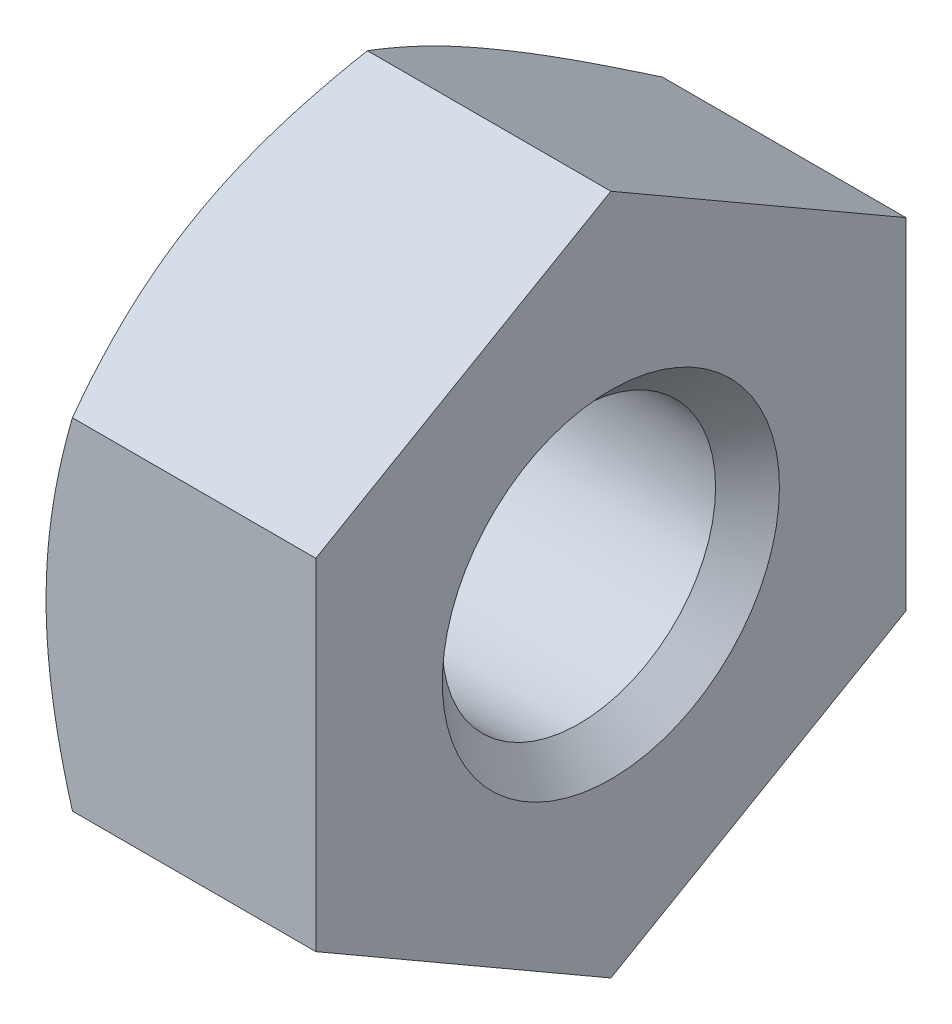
ISO-10303-21;
HEADER;
FILE_DESCRIPTION(('STEP AP214'),'2;1');
FILE_NAME('part.step','',(''),(''),'','','');
FILE_SCHEMA(('AUTOMOTIVE_DESIGN { 1 0 10303 214 1 1 1 1 }'));
ENDSEC;
DATA;
#1=APPLICATION_CONTEXT('core data for automotive mechanical design processes');
#2=APPLICATION_PROTOCOL_DEFINITION('international standard','automotive_design',2000,#1);
#3=PRODUCT_CONTEXT('',#1,'mechanical');
#4=PRODUCT('Part','Part','',(#3));
#5=PRODUCT_RELATED_PRODUCT_CATEGORY('part','',(#4));
#6=PRODUCT_DEFINITION_FORMATION('','',#4);
#7=PRODUCT_DEFINITION_CONTEXT('part definition',#1,'design');
#8=PRODUCT_DEFINITION('design','',#6,#7);
#9=PRODUCT_DEFINITION_SHAPE('','',#8);
#10=(LENGTH_UNIT() NAMED_UNIT(*) SI_UNIT(.MILLI.,.METRE.));
#11=(NAMED_UNIT(*) PLANE_ANGLE_UNIT() SI_UNIT($,.RADIAN.));
#12=(NAMED_UNIT(*) SI_UNIT($,.STERADIAN.) SOLID_ANGLE_UNIT());
#13=UNCERTAINTY_MEASURE_WITH_UNIT(LENGTH_MEASURE(1.E-05),#10,'distance_accuracy_value','');
#14=(GEOMETRIC_REPRESENTATION_CONTEXT(3) GLOBAL_UNCERTAINTY_ASSIGNED_CONTEXT((#13)) GLOBAL_UNIT_ASSIGNED_CONTEXT((#10,
#11,#12)) REPRESENTATION_CONTEXT('',''));
#15=CARTESIAN_POINT('',(0.,0.,0.));
#16=DIRECTION('',(0.,0.,1.));
#17=DIRECTION('',(1.,0.,0.));
#18=AXIS2_PLACEMENT_3D('',#15,#16,#17);
#19=CARTESIAN_POINT('',(-1.6,0.,0.));
#20=DIRECTION('',(1.,0.,0.));
#21=DIRECTION('',(0.,0.,-1.));
#22=AXIS2_PLACEMENT_3D('',#19,#20,#21);
#23=CONICAL_SURFACE('',#22,3.5,1.04719755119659);
#24=CARTESIAN_POINT('',(-1.59999999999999,-3.0310889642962,1.74999991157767));
#25=CARTESIAN_POINT('',(-1.59999060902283,-3.01672914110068,1.77490510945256));
#26=CARTESIAN_POINT('',(-1.59978868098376,-3.00235060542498,1.79979987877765));
#27=CARTESIAN_POINT('',(-1.59898295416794,-2.97378956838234,1.84924651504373));
#28=CARTESIAN_POINT('',(-1.5983846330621,-2.95960704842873,1.87379846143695));
#29=CARTESIAN_POINT('',(-1.59677330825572,-2.93133532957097,1.92281607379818));
#30=CARTESIAN_POINT('',(-1.59576191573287,-2.91724598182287,1.94728170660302));
#31=CARTESIAN_POINT('',(-1.59333461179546,-2.88902797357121,1.99631241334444));
#32=CARTESIAN_POINT('',(-1.59191695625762,-2.87489940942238,2.02087745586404));
#33=CARTESIAN_POINT('',(-1.58868520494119,-2.84660283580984,2.07007762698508));
#34=CARTESIAN_POINT('',(-1.58686969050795,-2.83243486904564,2.09471268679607));
#35=CARTESIAN_POINT('',(-1.58285079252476,-2.8040628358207,2.14402337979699));
#36=CARTESIAN_POINT('',(-1.58064632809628,-2.78985878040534,2.16869893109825));
#37=CARTESIAN_POINT('',(-1.57585794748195,-2.76142245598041,2.21806155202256));
#38=CARTESIAN_POINT('',(-1.57327329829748,-2.74719018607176,2.24274854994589));
#39=CARTESIAN_POINT('',(-1.5677330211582,-2.71870971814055,2.29210533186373));
#40=CARTESIAN_POINT('',(-1.56477701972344,-2.7044615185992,2.31677507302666));
#41=CARTESIAN_POINT('',(-1.55850237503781,-2.67596633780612,2.36606915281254));
#42=CARTESIAN_POINT('',(-1.55518373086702,-2.66171935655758,2.39069349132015));
#43=CARTESIAN_POINT('',(-1.54819255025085,-2.63324782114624,2.43986876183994));
#44=CARTESIAN_POINT('',(-1.54452040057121,-2.61902325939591,2.46441974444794));
#45=CARTESIAN_POINT('',(-1.53682935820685,-2.59062540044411,2.51342215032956));
#46=CARTESIAN_POINT('',(-1.53281126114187,-2.57645205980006,2.53787367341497));
#47=CARTESIAN_POINT('',(-1.52444133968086,-2.54818043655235,2.58664705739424));
#48=CARTESIAN_POINT('',(-1.52009072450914,-2.53408206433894,2.61096907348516));
#49=CARTESIAN_POINT('',(-1.51104733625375,-2.50602810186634,2.65946895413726));
#50=CARTESIAN_POINT('',(-1.50635634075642,-2.49207215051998,2.68364694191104));
#51=CARTESIAN_POINT('',(-1.49672746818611,-2.46427425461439,2.73169443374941));
#52=CARTESIAN_POINT('',(-1.49179245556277,-2.45043253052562,2.7555646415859));
#53=CARTESIAN_POINT('',(-1.48168778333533,-2.42285704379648,2.80301383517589));
#54=CARTESIAN_POINT('',(-1.47652070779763,-2.40912346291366,2.82659347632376));
#55=CARTESIAN_POINT('',(-1.46592189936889,-2.38175416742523,2.87357615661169));
#56=CARTESIAN_POINT('',(-1.46049171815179,-2.36811832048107,2.8969794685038));
#57=CARTESIAN_POINT('',(-1.44934444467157,-2.34091144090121,2.94371595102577));
#58=CARTESIAN_POINT('',(-1.44362770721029,-2.32734034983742,2.96704917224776));
#59=CARTESIAN_POINT('',(-1.43188314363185,-2.30022384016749,3.01375119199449));
#60=CARTESIAN_POINT('',(-1.4258544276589,-2.28667862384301,3.03711988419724));
#61=CARTESIAN_POINT('',(-1.413462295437,-2.25956443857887,3.08399569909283));
#62=CARTESIAN_POINT('',(-1.40709674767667,-2.2459960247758,3.10750257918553));
#63=CARTESIAN_POINT('',(-1.39400716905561,-2.21877701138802,3.15475516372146));
#64=CARTESIAN_POINT('',(-1.38727982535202,-2.20512729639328,3.17850045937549));
#65=CARTESIAN_POINT('',(-1.37344282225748,-2.17767797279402,3.22632753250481));
#66=CARTESIAN_POINT('',(-1.36632878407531,-2.1638794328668,3.25040865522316));
#67=CARTESIAN_POINT('',(-1.35169441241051,-2.13605542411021,3.29900213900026));
#68=CARTESIAN_POINT('',(-1.34416879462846,-2.12203094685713,3.32351347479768));
#69=CARTESIAN_POINT('',(-1.32868709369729,-2.09366878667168,3.37305910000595));
#70=CARTESIAN_POINT('',(-1.32072501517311,-2.07933165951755,3.3980918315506));
#71=CARTESIAN_POINT('',(-1.30434605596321,-2.05024736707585,3.44876824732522));
#72=CARTESIAN_POINT('',(-1.29592268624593,-2.03549985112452,3.47440963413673));
#73=CARTESIAN_POINT('',(-1.28739260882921,-2.02072594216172,3.50000000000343));
#74=B_SPLINE_CURVE_WITH_KNOTS('',3,(#24,#25,#26,#27,#28,#29,#30,#31,#32,#33,#34,#35,#36,#37,#38,
#39,#40,#41,#42,#43,#44,#45,#46,#47,#48,#49,#50,#51,#52,#53,#54,#55,#56,#57,#58,#59,#60,#61,#62,
#63,#64,#65,#66,#67,#68,#69,#70,#71,#72,#73),.UNSPECIFIED.,.F.,.F.,(4,2,2,2,2,2,2,2,2,2,2,2,2,2,
2,2,2,2,2,2,2,2,2,2,4),(0.,0.086245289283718,0.17132296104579,0.256071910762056,
0.341190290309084,0.426617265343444,0.512285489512,0.59812110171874,0.684043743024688,
0.769966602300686,0.855796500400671,0.941434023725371,1.02677371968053,1.11169601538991,
1.19578745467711,1.27910328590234,1.36197654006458,1.44474960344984,1.52777339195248,
1.61140644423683,1.69601400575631,1.78196718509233,1.86964226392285,1.95942023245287,
2.0516866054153),.UNSPECIFIED.);
#75=CARTESIAN_POINT('',(-1.6,-3.03108891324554,1.75));
#76=VERTEX_POINT('',#75);
#77=CARTESIAN_POINT('',(-1.28739260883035,-2.0207259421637,3.5));
#78=VERTEX_POINT('',#77);
#79=EDGE_CURVE('E103',#76,#78,#74,.T.);
#80=ORIENTED_EDGE('',*,*,#79,.T.);
#81=CARTESIAN_POINT('',(-1.28739075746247,-2.02073235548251,3.5));
#82=CARTESIAN_POINT('',(-1.29078374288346,-2.00897874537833,3.49999999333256));
#83=CARTESIAN_POINT('',(-1.29415623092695,-1.99721921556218,3.49999999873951));
#84=CARTESIAN_POINT('',(-1.30085910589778,-1.97368974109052,3.49999998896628));
#85=CARTESIAN_POINT('',(-1.30418949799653,-1.96191979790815,3.49999997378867));
#86=CARTESIAN_POINT('',(-1.31080321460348,-1.93838473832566,3.49999987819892));
#87=CARTESIAN_POINT('',(-1.3140865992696,-1.92661963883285,3.49999979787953));
#88=CARTESIAN_POINT('',(-1.32061661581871,-1.90305471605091,3.49999979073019));
#89=CARTESIAN_POINT('',(-1.32386316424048,-1.89125486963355,3.49999986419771));
#90=CARTESIAN_POINT('',(-1.33030210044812,-1.86768279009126,3.49999894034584));
#91=CARTESIAN_POINT('',(-1.33349463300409,-1.85591059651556,3.49999794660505));
#92=CARTESIAN_POINT('',(-1.33983293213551,-1.83236086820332,3.49999726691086));
#93=CARTESIAN_POINT('',(-1.34297872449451,-1.82058334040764,3.49999758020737));
#94=CARTESIAN_POINT('',(-1.34923773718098,-1.7969676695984,3.49999909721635));
#95=CARTESIAN_POINT('',(-1.35235076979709,-1.7851294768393,3.50000030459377));
#96=CARTESIAN_POINT('',(-1.35853304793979,-1.76143802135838,3.49999969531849));
#97=CARTESIAN_POINT('',(-1.36160228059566,-1.74958475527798,3.49999787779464));
#98=CARTESIAN_POINT('',(-1.36767897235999,-1.72592674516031,3.49999292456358));
#99=CARTESIAN_POINT('',(-1.37068666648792,-1.71412206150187,3.49998979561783));
#100=CARTESIAN_POINT('',(-1.37664587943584,-1.69053413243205,3.49998463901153));
#101=CARTESIAN_POINT('',(-1.37959753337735,-1.67875092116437,3.49998260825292));
#102=CARTESIAN_POINT('',(-1.38545049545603,-1.65517918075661,3.4999805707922));
#103=CARTESIAN_POINT('',(-1.3883518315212,-1.64339065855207,3.49998056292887));
#104=CARTESIAN_POINT('',(-1.39410992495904,-1.6197818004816,3.49998260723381));
#105=CARTESIAN_POINT('',(-1.3969665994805,-1.60796144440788,3.49998466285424));
#106=CARTESIAN_POINT('',(-1.40264118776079,-1.58426272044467,3.49998975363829));
#107=CARTESIAN_POINT('',(-1.40545890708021,-1.57238430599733,3.49999279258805));
#108=CARTESIAN_POINT('',(-1.41106127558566,-1.54854353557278,3.49999800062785));
#109=CARTESIAN_POINT('',(-1.41384561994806,-1.53658110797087,3.50000016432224));
#110=CARTESIAN_POINT('',(-1.41936816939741,-1.51263015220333,3.49999983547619));
#111=CARTESIAN_POINT('',(-1.42210631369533,-1.50064161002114,3.49999733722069));
#112=CARTESIAN_POINT('',(-1.42751927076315,-1.47670718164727,3.49998901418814));
#113=CARTESIAN_POINT('',(-1.43019431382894,-1.46476134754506,3.49998320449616));
#114=CARTESIAN_POINT('',(-1.43548199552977,-1.44090336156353,3.49997024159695));
#115=CARTESIAN_POINT('',(-1.43809483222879,-1.42899125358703,3.4999630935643));
#116=CARTESIAN_POINT('',(-1.44325915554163,-1.40519180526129,3.49994886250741));
#117=CARTESIAN_POINT('',(-1.44581080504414,-1.39330450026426,3.49994177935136));
#118=CARTESIAN_POINT('',(-1.45085377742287,-1.36954576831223,3.4999288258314));
#119=CARTESIAN_POINT('',(-1.45334522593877,-1.35767436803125,3.49992295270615));
#120=CARTESIAN_POINT('',(-1.45826883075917,-1.33393859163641,3.49991322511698));
#121=CARTESIAN_POINT('',(-1.4607010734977,-1.32207423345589,3.49990936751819));
#122=CARTESIAN_POINT('',(-1.46550730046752,-1.2983437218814,3.49990415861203));
#123=CARTESIAN_POINT('',(-1.46788133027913,-1.28647757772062,3.4999028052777));
#124=CARTESIAN_POINT('',(-1.47257216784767,-1.26273471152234,3.49990276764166));
#125=CARTESIAN_POINT('',(-1.47488897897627,-1.25085799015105,3.4999040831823));
#126=CARTESIAN_POINT('',(-1.47946641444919,-1.22708522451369,3.49990922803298));
#127=CARTESIAN_POINT('',(-1.48172699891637,-1.21518917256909,3.49991305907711));
#128=CARTESIAN_POINT('',(-1.48619302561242,-1.19136904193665,3.49992274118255));
#129=CARTESIAN_POINT('',(-1.48839838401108,-1.17944494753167,3.49992859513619));
#130=CARTESIAN_POINT('',(-1.4927549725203,-1.15556006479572,3.49994156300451));
#131=CARTESIAN_POINT('',(-1.49490607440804,-1.14359925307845,3.4999486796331));
#132=CARTESIAN_POINT('',(-1.49915528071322,-1.11963233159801,3.49996287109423));
#133=CARTESIAN_POINT('',(-1.50125321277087,-1.10762619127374,3.499969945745));
#134=CARTESIAN_POINT('',(-1.50539677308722,-1.08355998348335,3.49998323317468));
#135=CARTESIAN_POINT('',(-1.50744218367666,-1.07149987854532,3.49998944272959));
#136=CARTESIAN_POINT('',(-1.51148303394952,-1.04731742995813,3.49999681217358));
#137=CARTESIAN_POINT('',(-1.51347821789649,-1.03519504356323,3.49999795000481));
#138=CARTESIAN_POINT('',(-1.51741066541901,-1.01090423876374,3.50000205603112));
#139=CARTESIAN_POINT('',(-1.51934774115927,-0.998735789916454,3.5000050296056));
#140=CARTESIAN_POINT('',(-1.52315500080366,-0.974376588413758,3.50001991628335));
#141=CARTESIAN_POINT('',(-1.52502511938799,-0.962185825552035,3.50003183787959));
#142=CARTESIAN_POINT('',(-1.52869942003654,-0.937784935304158,3.50006045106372));
#143=CARTESIAN_POINT('',(-1.53050355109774,-0.925574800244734,3.50007714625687));
#144=CARTESIAN_POINT('',(-1.53404517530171,-0.901137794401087,3.50011435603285));
#145=CARTESIAN_POINT('',(-1.53578263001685,-0.888910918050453,3.50013487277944));
#146=CARTESIAN_POINT('',(-1.53919064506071,-0.864443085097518,3.500178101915));
#147=CARTESIAN_POINT('',(-1.5408611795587,-0.852202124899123,3.50020081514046));
#148=CARTESIAN_POINT('',(-1.54413497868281,-0.8277087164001,3.50024718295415));
#149=CARTESIAN_POINT('',(-1.54573822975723,-0.815456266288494,3.50027083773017));
#150=CARTESIAN_POINT('',(-1.548877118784,-0.790942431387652,3.50031792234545));
#151=CARTESIAN_POINT('',(-1.55041275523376,-0.778681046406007,3.5003413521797));
#152=CARTESIAN_POINT('',(-1.55341606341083,-0.754151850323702,3.50038698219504));
#153=CARTESIAN_POINT('',(-1.55488374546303,-0.741884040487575,3.50040918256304));
#154=CARTESIAN_POINT('',(-1.55775079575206,-0.717344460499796,3.50045148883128));
#155=CARTESIAN_POINT('',(-1.55915018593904,-0.705072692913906,3.50047159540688));
#156=CARTESIAN_POINT('',(-1.5618803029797,-0.680527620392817,3.5005089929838));
#157=CARTESIAN_POINT('',(-1.56321106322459,-0.668254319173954,3.50052628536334));
#158=CARTESIAN_POINT('',(-1.56580357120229,-0.643708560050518,3.50055747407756));
#159=CARTESIAN_POINT('',(-1.56706536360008,-0.631436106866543,3.50057137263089));
#160=CARTESIAN_POINT('',(-1.56951958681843,-0.606894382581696,3.50059533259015));
#161=CARTESIAN_POINT('',(-1.57071207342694,-0.594625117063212,3.5006053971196));
#162=CARTESIAN_POINT('',(-1.57302733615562,-0.570092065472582,3.5006213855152));
#163=CARTESIAN_POINT('',(-1.5741501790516,-0.557828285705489,3.50062731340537));
#164=CARTESIAN_POINT('',(-1.57632580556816,-0.533308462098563,3.50063486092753));
#165=CARTESIAN_POINT('',(-1.57737866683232,-0.521052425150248,3.50063648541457));
#166=CARTESIAN_POINT('',(-1.57941398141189,-0.496550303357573,3.50063539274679));
#167=CARTESIAN_POINT('',(-1.58039652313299,-0.484304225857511,3.50063268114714));
#168=CARTESIAN_POINT('',(-1.58229085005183,-0.459824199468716,3.50062301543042));
#169=CARTESIAN_POINT('',(-1.5832027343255,-0.447590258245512,3.50061606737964));
#170=CARTESIAN_POINT('',(-1.58495539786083,-0.423136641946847,3.50059815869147));
#171=CARTESIAN_POINT('',(-1.58579628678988,-0.410916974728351,3.50058720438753));
#172=CARTESIAN_POINT('',(-1.58740661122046,-0.386494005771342,3.50056164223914));
#173=CARTESIAN_POINT('',(-1.58817616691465,-0.374290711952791,3.50054704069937));
#174=CARTESIAN_POINT('',(-1.58964347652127,-0.349902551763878,3.50051467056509));
#175=CARTESIAN_POINT('',(-1.59034136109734,-0.337717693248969,3.50049690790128));
#176=CARTESIAN_POINT('',(-1.59166498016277,-0.313368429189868,3.50045882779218));
#177=CARTESIAN_POINT('',(-1.59229085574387,-0.301204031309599,3.50043851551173));
#178=CARTESIAN_POINT('',(-1.59347010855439,-0.276897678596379,3.50039607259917));
#179=CARTESIAN_POINT('',(-1.59402363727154,-0.26475573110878,3.50037394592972));
#180=CARTESIAN_POINT('',(-1.59505784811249,-0.240496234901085,3.50032873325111));
#181=CARTESIAN_POINT('',(-1.59553869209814,-0.228378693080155,3.5003056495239));
#182=CARTESIAN_POINT('',(-1.59642718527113,-0.204169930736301,3.50025950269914));
#183=CARTESIAN_POINT('',(-1.59683500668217,-0.192078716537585,3.50023643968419));
#184=CARTESIAN_POINT('',(-1.59757710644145,-0.167924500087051,3.50019143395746));
#185=CARTESIAN_POINT('',(-1.59791156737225,-0.155861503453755,3.50016948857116));
#186=CARTESIAN_POINT('',(-1.59850659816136,-0.131765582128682,3.50012793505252));
#187=CARTESIAN_POINT('',(-1.59876736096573,-0.119732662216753,3.50010832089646));
#188=CARTESIAN_POINT('',(-1.5992146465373,-0.0956987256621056,3.50007276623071));
#189=CARTESIAN_POINT('',(-1.59940137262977,-0.0836977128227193,3.50005681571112));
#190=CARTESIAN_POINT('',(-1.59970023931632,-0.0597293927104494,3.50003002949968));
#191=CARTESIAN_POINT('',(-1.59981259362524,-0.0477620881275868,3.50001917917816));
#192=CARTESIAN_POINT('',(-1.59996235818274,-0.0238629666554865,3.5000041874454));
#193=CARTESIAN_POINT('',(-1.59999999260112,-0.0119311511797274,3.50000002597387));
#194=CARTESIAN_POINT('',(-1.59999999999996,6.72072123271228E-07,3.5));
#195=B_SPLINE_CURVE_WITH_KNOTS('',3,(#81,#82,#83,#84,#85,#86,#87,#88,#89,#90,#91,#92,#93,#94,
#95,#96,#97,#98,#99,#100,#101,#102,#103,#104,#105,#106,#107,#108,#109,#110,#111,#112,#113,#114,
#115,#116,#117,#118,#119,#120,#121,#122,#123,#124,#125,#126,#127,#128,#129,#130,#131,#132,#133,
#134,#135,#136,#137,#138,#139,#140,#141,#142,#143,#144,#145,#146,#147,#148,#149,#150,#151,#152,
#153,#154,#155,#156,#157,#158,#159,#160,#161,#162,#163,#164,#165,#166,#167,#168,#169,#170,#171,
#172,#173,#174,#175,#176,#177,#178,#179,#180,#181,#182,#183,#184,#185,#186,#187,#188,#189,#190,
#191,#192,#193,#194),.UNSPECIFIED.,.F.,.F.,(4,2,2,2,2,2,2,2,2,2,2,2,2,2,2,2,2,2,2,2,2,2,2,2,2,2,
2,2,2,2,2,2,2,2,2,2,2,2,2,2,2,2,2,2,2,2,2,2,2,2,2,2,2,2,2,2,4),(0.,0.0367006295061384,
0.073396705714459,0.110040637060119,0.146755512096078,0.183347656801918,0.219918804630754,
0.256640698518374,0.293373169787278,0.329918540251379,0.366360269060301,0.40278107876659,
0.439262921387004,0.475886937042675,0.512733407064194,0.549625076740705,0.586350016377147,
0.622935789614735,0.659409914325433,0.695799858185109,0.732133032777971,0.7684367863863,
0.80473839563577,0.841065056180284,0.877443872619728,0.913901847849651,0.95046587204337,
0.987162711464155,1.02401899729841,1.06098380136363,1.09798373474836,1.13501168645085,
1.17206066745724,1.20912381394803,1.24619438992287,1.28326578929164,1.32033153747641,
1.35738529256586,1.39442084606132,1.43143212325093,1.46841318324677,1.50535821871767,
1.54226155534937,1.57911765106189,1.61592109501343,1.65266660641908,1.68934903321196,
1.72596335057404,1.76250465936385,1.79896818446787,1.8353492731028,1.87164339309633,
1.90784613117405,1.9439531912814,1.97996039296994,2.01586366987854,2.0516590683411),.UNSPECIFIED.);
#196=CARTESIAN_POINT('',(-1.6,0.,3.5));
#197=VERTEX_POINT('',#196);
#198=EDGE_CURVE('E88',#78,#197,#195,.T.);
#199=ORIENTED_EDGE('',*,*,#198,.T.);
#200=CARTESIAN_POINT('',(-1.6,0.,0.));
#201=DIRECTION('',(1.,0.,0.));
#202=DIRECTION('',(0.,0.,1.));
#203=AXIS2_PLACEMENT_3D('',#200,#201,#202);
#204=CIRCLE('',#203,3.5);
#205=EDGE_CURVE('E102',#197,#76,#204,.T.);
#206=ORIENTED_EDGE('',*,*,#205,.T.);
#207=EDGE_LOOP('',(#80,#199,#206));
#208=FACE_BOUND('',#207,.T.);
#209=ADVANCED_FACE('F17',(#208),#23,.T.);
#210=CARTESIAN_POINT('',(1.6,-2.0207259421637,3.5));
#211=DIRECTION('',(0.,0.866025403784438,-0.5));
#212=DIRECTION('',(0.,0.5,0.866025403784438));
#213=AXIS2_PLACEMENT_3D('',#210,#211,#212);
#214=PLANE('',#213);
#215=DIRECTION('',(-1.,0.,0.));
#216=VECTOR('',#215,1.);
#217=CARTESIAN_POINT('',(1.6,-4.0414518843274,0.));
#218=LINE('',#217,#216);
#219=CARTESIAN_POINT('',(1.6,-4.04145188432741,0.));
#220=VERTEX_POINT('',#219);
#221=CARTESIAN_POINT('',(-1.28739260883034,-4.0414518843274,0.));
#222=VERTEX_POINT('',#221);
#223=EDGE_CURVE('E369',#220,#222,#218,.T.);
#224=ORIENTED_EDGE('',*,*,#223,.F.);
#225=DIRECTION('',(0.,-0.5,-0.866025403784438));
#226=VECTOR('',#225,1.);
#227=CARTESIAN_POINT('',(1.6,-2.0207259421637,3.5));
#228=LINE('',#227,#226);
#229=CARTESIAN_POINT('',(1.6,-2.0207259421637,3.5));
#230=VERTEX_POINT('',#229);
#231=EDGE_CURVE('E113',#230,#220,#228,.T.);
#232=ORIENTED_EDGE('',*,*,#231,.F.);
#233=DIRECTION('',(-1.,0.,0.));
#234=VECTOR('',#233,1.);
#235=CARTESIAN_POINT('',(1.6,-2.0207259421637,3.5));
#236=LINE('',#235,#234);
#237=EDGE_CURVE('E93',#230,#78,#236,.T.);
#238=ORIENTED_EDGE('',*,*,#237,.T.);
#239=ORIENTED_EDGE('',*,*,#79,.F.);
#240=CARTESIAN_POINT('',(-1.28739260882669,-4.04145188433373,-1.09724518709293E-11));
#241=CARTESIAN_POINT('',(-1.30027130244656,-4.01914328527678,0.0386333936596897));
#242=CARTESIAN_POINT('',(-1.31291041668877,-3.99669974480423,0.0772699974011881));
#243=CARTESIAN_POINT('',(-1.33711319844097,-3.9525503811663,0.153088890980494));
#244=CARTESIAN_POINT('',(-1.34869965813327,-3.93085090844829,0.190267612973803));
#245=CARTESIAN_POINT('',(-1.37088064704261,-3.88809990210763,0.263579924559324));
#246=CARTESIAN_POINT('',(-1.38149513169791,-3.86705009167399,0.299708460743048));
#247=CARTESIAN_POINT('',(-1.40181787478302,-3.82546367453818,0.371290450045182));
#248=CARTESIAN_POINT('',(-1.41154175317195,-3.80492685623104,0.40673933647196));
#249=CARTESIAN_POINT('',(-1.43016936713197,-3.76419671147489,0.477299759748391));
#250=CARTESIAN_POINT('',(-1.43908326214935,-3.74400287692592,0.512408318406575));
#251=CARTESIAN_POINT('',(-1.45618126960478,-3.70374941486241,0.582589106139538));
#252=CARTESIAN_POINT('',(-1.46436941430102,-3.68368970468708,0.617660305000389));
#253=CARTESIAN_POINT('',(-1.48009452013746,-3.64348180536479,0.688047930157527));
#254=CARTESIAN_POINT('',(-1.48762937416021,-3.62333353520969,0.723364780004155));
#255=CARTESIAN_POINT('',(-1.50217166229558,-3.58262664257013,0.794443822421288));
#256=CARTESIAN_POINT('',(-1.50917180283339,-3.56206598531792,0.830206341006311));
#257=CARTESIAN_POINT('',(-1.52256210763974,-3.52054933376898,0.902345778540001));
#258=CARTESIAN_POINT('',(-1.5289416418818,-3.49959201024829,0.938723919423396));
#259=CARTESIAN_POINT('',(-1.54091936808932,-3.45750951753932,1.01198101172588));
#260=CARTESIAN_POINT('',(-1.54650957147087,-3.43638464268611,1.04886143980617));
#261=CARTESIAN_POINT('',(-1.55691544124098,-3.3939395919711,1.1228821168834));
#262=CARTESIAN_POINT('',(-1.5617268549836,-3.37261897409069,1.16002270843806));
#263=CARTESIAN_POINT('',(-1.57053545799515,-3.32984915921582,1.23439532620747));
#264=CARTESIAN_POINT('',(-1.57453151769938,-3.30839982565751,1.27162740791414));
#265=CARTESIAN_POINT('',(-1.58168271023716,-3.26544233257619,1.34602409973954));
#266=CARTESIAN_POINT('',(-1.58483974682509,-3.24393442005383,1.38318866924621));
#267=CARTESIAN_POINT('',(-1.59028254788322,-3.20095740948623,1.45731803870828));
#268=CARTESIAN_POINT('',(-1.59257321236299,-3.17948879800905,1.49428276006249));
#269=CARTESIAN_POINT('',(-1.5962549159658,-3.13670573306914,1.56790024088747));
#270=CARTESIAN_POINT('',(-1.59765388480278,-3.11539163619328,1.60455280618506));
#271=CARTESIAN_POINT('',(-1.59951956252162,-3.07306240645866,1.67745892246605));
#272=CARTESIAN_POINT('',(-1.59999739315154,-3.05204678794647,1.71371191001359));
#273=CARTESIAN_POINT('',(-1.59999999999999,-3.0310889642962,1.74999991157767));
#274=B_SPLINE_CURVE_WITH_KNOTS('',3,(#240,#241,#242,#243,#244,#245,#246,#247,#248,#249,#250,
#251,#252,#253,#254,#255,#256,#257,#258,#259,#260,#261,#262,#263,#264,#265,#266,#267,#268,#269,
#270,#271,#272,#273),.UNSPECIFIED.,.F.,.F.,(4,2,2,2,2,2,2,2,2,2,2,2,2,2,2,2,4),(0.,
0.139301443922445,0.273037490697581,0.402451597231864,0.528764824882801,0.653172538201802,
0.776838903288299,0.90089035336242,1.02640927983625,1.153796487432,1.28239247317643,
1.41166856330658,1.54112255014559,1.6702802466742,1.79869612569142,1.92595347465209,
2.05166446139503),.UNSPECIFIED.);
#275=EDGE_CURVE('E114',#222,#76,#274,.T.);
#276=ORIENTED_EDGE('',*,*,#275,.F.);
#277=EDGE_LOOP('',(#224,#232,#238,#239,#276));
#278=FACE_BOUND('',#277,.T.);
#279=ADVANCED_FACE('F110',(#278),#214,.F.);
#280=CARTESIAN_POINT('',(1.6,2.0207259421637,3.5));
#281=DIRECTION('',(0.,0.,-1.));
#282=DIRECTION('',(-1.,0.,0.));
#283=AXIS2_PLACEMENT_3D('',#280,#281,#282);
#284=PLANE('',#283);
#285=ORIENTED_EDGE('',*,*,#237,.F.);
#286=DIRECTION('',(0.,-1.,0.));
#287=VECTOR('',#286,1.);
#288=CARTESIAN_POINT('',(1.6,2.0207259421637,3.5));
#289=LINE('',#288,#287);
#290=CARTESIAN_POINT('',(1.6,2.0207259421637,3.5));
#291=VERTEX_POINT('',#290);
#292=EDGE_CURVE('E202',#291,#230,#289,.T.);
#293=ORIENTED_EDGE('',*,*,#292,.F.);
#294=DIRECTION('',(-1.,0.,0.));
#295=VECTOR('',#294,1.);
#296=CARTESIAN_POINT('',(1.6,2.0207259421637,3.5));
#297=LINE('',#296,#295);
#298=CARTESIAN_POINT('',(-1.28739260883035,2.0207259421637,3.5));
#299=VERTEX_POINT('',#298);
#300=EDGE_CURVE('E322',#291,#299,#297,.T.);
#301=ORIENTED_EDGE('',*,*,#300,.T.);
#302=CARTESIAN_POINT('',(-1.59999999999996,6.72072123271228E-07,3.5));
#303=CARTESIAN_POINT('',(-1.60000062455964,0.014368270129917,3.49999893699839));
#304=CARTESIAN_POINT('',(-1.59994958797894,0.0287358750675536,3.49999884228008));
#305=CARTESIAN_POINT('',(-1.5997451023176,0.0572677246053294,3.50000166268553));
#306=CARTESIAN_POINT('',(-1.59959310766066,0.0714319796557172,3.5000045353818));
#307=CARTESIAN_POINT('',(-1.59918752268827,0.0997674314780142,3.5000142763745));
#308=CARTESIAN_POINT('',(-1.59893387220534,0.113938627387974,3.50002114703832));
#309=CARTESIAN_POINT('',(-1.59832587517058,0.142287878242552,3.50003728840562));
#310=CARTESIAN_POINT('',(-1.59797146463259,0.156465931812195,3.50004656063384));
#311=CARTESIAN_POINT('',(-1.5971624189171,0.18482875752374,3.50006672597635));
#312=CARTESIAN_POINT('',(-1.59670771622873,0.199013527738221,3.50007762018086));
#313=CARTESIAN_POINT('',(-1.59569867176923,0.227389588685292,3.50010014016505));
#314=CARTESIAN_POINT('',(-1.59514425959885,0.241580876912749,3.50011176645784));
#315=CARTESIAN_POINT('',(-1.59393635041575,0.269969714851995,3.50013500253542));
#316=CARTESIAN_POINT('',(-1.59328278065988,0.284167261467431,3.50014661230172));
#317=CARTESIAN_POINT('',(-1.59187711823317,0.312568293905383,3.50016914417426));
#318=CARTESIAN_POINT('',(-1.59112495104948,0.326771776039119,3.50018006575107));
#319=CARTESIAN_POINT('',(-1.58952265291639,0.355184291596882,3.50020064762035));
#320=CARTESIAN_POINT('',(-1.58867244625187,0.369393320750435,3.50021030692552));
#321=CARTESIAN_POINT('',(-1.58687462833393,0.397816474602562,3.50022788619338));
#322=CARTESIAN_POINT('',(-1.58592694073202,0.412030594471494,3.50023580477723));
#323=CARTESIAN_POINT('',(-1.58393471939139,0.44046340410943,3.50024952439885));
#324=CARTESIAN_POINT('',(-1.5828901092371,0.45468208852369,3.50025532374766));
#325=CARTESIAN_POINT('',(-1.58070460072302,0.483123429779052,3.50026452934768));
#326=CARTESIAN_POINT('',(-1.57956362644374,0.497346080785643,3.50026793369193));
#327=CARTESIAN_POINT('',(-1.57718594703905,0.525794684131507,3.50027217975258));
#328=CARTESIAN_POINT('',(-1.57594916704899,0.540020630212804,3.50027301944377));
#329=CARTESIAN_POINT('',(-1.57338043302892,0.568475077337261,3.50027207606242));
#330=CARTESIAN_POINT('',(-1.57204840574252,0.582703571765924,3.50027029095));
#331=CARTESIAN_POINT('',(-1.56928973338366,0.6111622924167,3.50026415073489));
#332=CARTESIAN_POINT('',(-1.56786301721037,0.625392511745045,3.50025979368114));
#333=CARTESIAN_POINT('',(-1.56491552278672,0.653853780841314,3.5002486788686));
#334=CARTESIAN_POINT('',(-1.56339467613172,0.668084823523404,3.50024191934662));
#335=CARTESIAN_POINT('',(-1.56025947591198,0.696546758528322,3.50022628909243));
#336=CARTESIAN_POINT('',(-1.55864505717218,0.710777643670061,3.50021741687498));
#337=CARTESIAN_POINT('',(-1.55532326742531,0.739238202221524,3.50019797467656));
#338=CARTESIAN_POINT('',(-1.55361583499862,0.753467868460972,3.50018740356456));
#339=CARTESIAN_POINT('',(-1.55010857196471,0.781924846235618,3.50016510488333));
#340=CARTESIAN_POINT('',(-1.54830868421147,0.796152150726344,3.50015337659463));
#341=CARTESIAN_POINT('',(-1.54461706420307,0.824603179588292,3.50012943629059));
#342=CARTESIAN_POINT('',(-1.54272527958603,0.838826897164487,3.50011722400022));
#343=CARTESIAN_POINT('',(-1.5388504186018,0.867269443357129,3.5000931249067));
#344=CARTESIAN_POINT('',(-1.53686729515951,0.881488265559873,3.50008123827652));
#345=CARTESIAN_POINT('',(-1.53281031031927,0.909919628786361,3.50005873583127));
#346=CARTESIAN_POINT('',(-1.53073640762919,0.924132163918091,3.50004812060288));
#347=CARTESIAN_POINT('',(-1.52649841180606,0.952549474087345,3.50002926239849));
#348=CARTESIAN_POINT('',(-1.52433428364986,0.966754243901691,3.5000210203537));
#349=CARTESIAN_POINT('',(-1.51991640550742,0.995154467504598,3.50000811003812));
#350=CARTESIAN_POINT('',(-1.51766262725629,1.00934991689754,3.50000344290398));
#351=CARTESIAN_POINT('',(-1.51306844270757,1.03771435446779,3.4999992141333));
#352=CARTESIAN_POINT('',(-1.51072811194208,1.05188335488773,3.49999964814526));
#353=CARTESIAN_POINT('',(-1.50597879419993,1.0801365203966,3.49999332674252));
#354=CARTESIAN_POINT('',(-1.50357021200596,1.0942207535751,3.49998660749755));
#355=CARTESIAN_POINT('',(-1.49868260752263,1.1223107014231,3.49997156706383));
#356=CARTESIAN_POINT('',(-1.49620395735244,1.136316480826,3.4999632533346));
#357=CARTESIAN_POINT('',(-1.49117497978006,1.16426378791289,3.4999467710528));
#358=CARTESIAN_POINT('',(-1.48862493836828,1.17820536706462,3.49993860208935));
#359=CARTESIAN_POINT('',(-1.4834514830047,1.20603856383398,3.49992435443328));
#360=CARTESIAN_POINT('',(-1.48082827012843,1.21993021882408,3.49991827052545));
#361=CARTESIAN_POINT('',(-1.47550689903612,1.24767796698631,3.49990927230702));
#362=CARTESIAN_POINT('',(-1.47280885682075,1.2615340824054,3.49990635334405));
#363=CARTESIAN_POINT('',(-1.46733622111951,1.28922523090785,3.49990419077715));
#364=CARTESIAN_POINT('',(-1.46456165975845,1.30306027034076,3.49990494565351));
#365=CARTESIAN_POINT('',(-1.45893438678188,1.33072382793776,3.49990999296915));
#366=CARTESIAN_POINT('',(-1.4560816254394,1.34455233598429,3.49991428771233));
#367=CARTESIAN_POINT('',(-1.45029634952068,1.37221746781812,3.49992565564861));
#368=CARTESIAN_POINT('',(-1.44736370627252,1.38605406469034,3.49993273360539));
#369=CARTESIAN_POINT('',(-1.44141705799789,1.41375008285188,3.49994829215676));
#370=CARTESIAN_POINT('',(-1.43840284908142,1.427609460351,3.49995677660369));
#371=CARTESIAN_POINT('',(-1.43229146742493,1.45536582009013,3.49997312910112));
#372=CARTESIAN_POINT('',(-1.42919402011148,1.46926274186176,3.49998099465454));
#373=CARTESIAN_POINT('',(-1.42291451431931,1.49710902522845,3.49999355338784));
#374=CARTESIAN_POINT('',(-1.41973211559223,1.51105831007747,3.49999823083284));
#375=CARTESIAN_POINT('',(-1.41329647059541,1.53895808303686,3.50000090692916));
#376=CARTESIAN_POINT('',(-1.41004314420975,1.55290855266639,3.49999889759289));
#377=CARTESIAN_POINT('',(-1.40348967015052,1.58070096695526,3.49999347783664));
#378=CARTESIAN_POINT('',(-1.40018997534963,1.59454301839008,3.4999900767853));
#379=CARTESIAN_POINT('',(-1.3935362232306,1.62215435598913,3.499984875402));
#380=CARTESIAN_POINT('',(-1.39018244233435,1.63592370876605,3.49998306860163));
#381=CARTESIAN_POINT('',(-1.38341194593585,1.66343036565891,3.49998225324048));
#382=CARTESIAN_POINT('',(-1.37999530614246,1.67716768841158,3.4999832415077));
#383=CARTESIAN_POINT('',(-1.37309048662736,1.70465150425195,3.49998743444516));
#384=CARTESIAN_POINT('',(-1.36960218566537,1.71839796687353,3.49999064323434));
#385=CARTESIAN_POINT('',(-1.36254560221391,1.74594181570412,3.49999651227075));
#386=CARTESIAN_POINT('',(-1.35897701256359,1.75973912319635,3.49999916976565));
#387=CARTESIAN_POINT('',(-1.35177343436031,1.7873397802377,3.50000067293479));
#388=CARTESIAN_POINT('',(-1.34813834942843,1.80114310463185,3.49999951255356));
#389=CARTESIAN_POINT('',(-1.34082050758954,1.82867904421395,3.49999830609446));
#390=CARTESIAN_POINT('',(-1.33713799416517,1.84241172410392,3.49999825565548));
#391=CARTESIAN_POINT('',(-1.32971204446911,1.86986276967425,3.49999918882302));
#392=CARTESIAN_POINT('',(-1.32596859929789,1.88358113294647,3.50000017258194));
#393=CARTESIAN_POINT('',(-1.31842620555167,1.91099414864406,3.49999981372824));
#394=CARTESIAN_POINT('',(-1.3146272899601,1.92468881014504,3.49999847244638));
#395=CARTESIAN_POINT('',(-1.30697120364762,1.95206198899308,3.49999719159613));
#396=CARTESIAN_POINT('',(-1.30311403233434,1.96574050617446,3.49999725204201));
#397=CARTESIAN_POINT('',(-1.29531168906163,1.99319115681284,3.49999817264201));
#398=CARTESIAN_POINT('',(-1.29136605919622,2.00696316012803,3.49999903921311));
#399=CARTESIAN_POINT('',(-1.28739229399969,2.02072703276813,3.50000000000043));
#400=B_SPLINE_CURVE_WITH_KNOTS('',3,(#302,#303,#304,#305,#306,#307,#308,#309,#310,#311,#312,
#313,#314,#315,#316,#317,#318,#319,#320,#321,#322,#323,#324,#325,#326,#327,#328,#329,#330,#331,
#332,#333,#334,#335,#336,#337,#338,#339,#340,#341,#342,#343,#344,#345,#346,#347,#348,#349,#350,
#351,#352,#353,#354,#355,#356,#357,#358,#359,#360,#361,#362,#363,#364,#365,#366,#367,#368,#369,
#370,#371,#372,#373,#374,#375,#376,#377,#378,#379,#380,#381,#382,#383,#384,#385,#386,#387,#388,
#389,#390,#391,#392,#393,#394,#395,#396,#397,#398,#399),.UNSPECIFIED.,.F.,.F.,(4,2,2,2,2,2,2,2,
2,2,2,2,2,2,2,2,2,2,2,2,2,2,2,2,2,2,2,2,2,2,2,2,2,2,2,2,2,2,2,2,2,2,2,2,2,2,2,2,4),(0.,
0.0431027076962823,0.0855975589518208,0.128117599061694,0.1706647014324,0.213240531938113,
0.255846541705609,0.298483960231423,0.341153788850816,0.383856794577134,0.426593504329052,
0.469364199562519,0.512168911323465,0.555007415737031,0.597879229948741,0.640783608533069,
0.683719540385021,0.72668574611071,0.76968067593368,0.812702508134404,0.855749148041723,
0.898818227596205,0.941907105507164,0.985012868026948,1.02813233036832,1.07121501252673,
1.1140808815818,1.15675089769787,1.19926929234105,1.24168054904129,1.28402937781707,
1.32636069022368,1.36871957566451,1.41115127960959,1.45370118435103,1.49641479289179,
1.5393377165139,1.58231193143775,1.62500149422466,1.66751704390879,1.70998436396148,
1.75253067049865,1.79528453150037,1.83810623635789,1.8807596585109,1.92341936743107,
1.96605466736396,2.00869040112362,2.05166845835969),.UNSPECIFIED.);
#401=EDGE_CURVE('E95',#197,#299,#400,.T.);
#402=ORIENTED_EDGE('',*,*,#401,.F.);
#403=ORIENTED_EDGE('',*,*,#198,.F.);
#404=EDGE_LOOP('',(#285,#293,#301,#402,#403));
#405=FACE_BOUND('',#404,.T.);
#406=ADVANCED_FACE('F91',(#405),#284,.F.);
#407=CARTESIAN_POINT('',(-1.6,0.,0.));
#408=DIRECTION('',(1.,0.,0.));
#409=DIRECTION('',(0.,0.,-1.));
#410=AXIS2_PLACEMENT_3D('',#407,#408,#409);
#411=PLANE('',#410);
#412=CARTESIAN_POINT('',(-1.6,0.,0.));
#413=DIRECTION('',(1.,0.,0.));
#414=DIRECTION('',(0.,0.,-1.));
#415=AXIS2_PLACEMENT_3D('',#412,#413,#414);
#416=CIRCLE('',#415,2.);
#417=CARTESIAN_POINT('',(-1.6,0.,-2.));
#418=VERTEX_POINT('',#417);
#419=EDGE_CURVE('E321',#418,#418,#416,.T.);
#420=ORIENTED_EDGE('',*,*,#419,.T.);
#421=EDGE_LOOP('',(#420));
#422=FACE_BOUND('',#421,.T.);
#423=CARTESIAN_POINT('',(-1.6,0.,0.));
#424=DIRECTION('',(1.,0.,0.));
#425=DIRECTION('',(0.,0.,-1.));
#426=AXIS2_PLACEMENT_3D('',#423,#424,#425);
#427=CIRCLE('',#426,3.5);
#428=CARTESIAN_POINT('',(-1.6,0.,-3.5));
#429=VERTEX_POINT('',#428);
#430=CARTESIAN_POINT('',(-1.6,3.03108891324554,-1.75));
#431=VERTEX_POINT('',#430);
#432=EDGE_CURVE('E214',#429,#431,#427,.T.);
#433=ORIENTED_EDGE('',*,*,#432,.F.);
#434=CARTESIAN_POINT('',(-1.6,0.,0.));
#435=DIRECTION('',(1.,0.,0.));
#436=DIRECTION('',(0.,-0.866025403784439,-0.499999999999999));
#437=AXIS2_PLACEMENT_3D('',#434,#435,#436);
#438=CIRCLE('',#437,3.5);
#439=CARTESIAN_POINT('',(-1.6,-3.03108891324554,-1.75));
#440=VERTEX_POINT('',#439);
#441=EDGE_CURVE('E209',#440,#429,#438,.T.);
#442=ORIENTED_EDGE('',*,*,#441,.F.);
#443=CARTESIAN_POINT('',(-1.6,0.,0.));
#444=DIRECTION('',(1.,0.,0.));
#445=DIRECTION('',(0.,-0.866025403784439,0.499999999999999));
#446=AXIS2_PLACEMENT_3D('',#443,#444,#445);
#447=CIRCLE('',#446,3.5);
#448=EDGE_CURVE('E197',#76,#440,#447,.T.);
#449=ORIENTED_EDGE('',*,*,#448,.F.);
#450=ORIENTED_EDGE('',*,*,#205,.F.);
#451=CARTESIAN_POINT('',(-1.6,0.,0.));
#452=DIRECTION('',(1.,0.,0.));
#453=DIRECTION('',(0.,0.866025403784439,0.499999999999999));
#454=AXIS2_PLACEMENT_3D('',#451,#452,#453);
#455=CIRCLE('',#454,3.5);
#456=CARTESIAN_POINT('',(-1.6,3.03108891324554,1.75));
#457=VERTEX_POINT('',#456);
#458=EDGE_CURVE('E210',#457,#197,#455,.T.);
#459=ORIENTED_EDGE('',*,*,#458,.F.);
#460=CARTESIAN_POINT('',(-1.6,0.,0.));
#461=DIRECTION('',(1.,0.,0.));
#462=DIRECTION('',(0.,0.866025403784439,-0.499999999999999));
#463=AXIS2_PLACEMENT_3D('',#460,#461,#462);
#464=CIRCLE('',#463,3.5);
#465=EDGE_CURVE('E212',#431,#457,#464,.T.);
#466=ORIENTED_EDGE('',*,*,#465,.F.);
#467=EDGE_LOOP('',(#433,#442,#449,#450,#459,#466));
#468=FACE_BOUND('',#467,.T.);
#469=ADVANCED_FACE('F206',(#422,#468),#411,.F.);
#470=CARTESIAN_POINT('',(1.6,-4.0414518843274,0.));
#471=DIRECTION('',(0.,0.866025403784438,0.5));
#472=DIRECTION('',(0.,-0.5,0.866025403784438));
#473=AXIS2_PLACEMENT_3D('',#470,#471,#472);
#474=PLANE('',#473);
#475=DIRECTION('',(-1.,0.,0.));
#476=VECTOR('',#475,1.);
#477=CARTESIAN_POINT('',(1.6,-2.0207259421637,-3.5));
#478=LINE('',#477,#476);
#479=CARTESIAN_POINT('',(1.6,-2.0207259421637,-3.5));
#480=VERTEX_POINT('',#479);
#481=CARTESIAN_POINT('',(-1.28739260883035,-2.0207259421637,-3.5));
#482=VERTEX_POINT('',#481);
#483=EDGE_CURVE('E225',#480,#482,#478,.T.);
#484=ORIENTED_EDGE('',*,*,#483,.F.);
#485=DIRECTION('',(0.,0.5,-0.866025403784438));
#486=VECTOR('',#485,1.);
#487=CARTESIAN_POINT('',(1.6,-4.0414518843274,0.));
#488=LINE('',#487,#486);
#489=EDGE_CURVE('E229',#220,#480,#488,.T.);
#490=ORIENTED_EDGE('',*,*,#489,.F.);
#491=ORIENTED_EDGE('',*,*,#223,.T.);
#492=CARTESIAN_POINT('',(-1.59999999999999,-3.0310888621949,-1.75000008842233));
#493=CARTESIAN_POINT('',(-1.59999060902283,-3.04547748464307,-1.72511151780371));
#494=CARTESIAN_POINT('',(-1.59978868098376,-3.0598477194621,-1.70021195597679));
#495=CARTESIAN_POINT('',(-1.59898295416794,-3.0883892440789,-1.65075405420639));
#496=CARTESIAN_POINT('',(-1.59838463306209,-3.10256059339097,-1.62619565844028));
#497=CARTESIAN_POINT('',(-1.59677330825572,-3.13087523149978,-1.57720282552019));
#498=CARTESIAN_POINT('',(-1.59576191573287,-3.14501841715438,-1.55276827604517));
#499=CARTESIAN_POINT('',(-1.59333461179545,-3.17337125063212,-1.50381541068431));
#500=CARTESIAN_POINT('',(-1.59191695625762,-3.18758091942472,-1.47929719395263));
#501=CARTESIAN_POINT('',(-1.58868520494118,-3.21604123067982,-1.43019155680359));
#502=CARTESIAN_POINT('',(-1.58686969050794,-3.23029183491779,-1.40560420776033));
#503=CARTESIAN_POINT('',(-1.58285079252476,-3.25881013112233,-1.35637795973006));
#504=CARTESIAN_POINT('',(-1.58064632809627,-3.27307775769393,-1.33173911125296));
#505=CARTESIAN_POINT('',(-1.57585794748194,-3.30160887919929,-1.28243122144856));
#506=CARTESIAN_POINT('',(-1.57327329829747,-3.31587231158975,-1.25776221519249));
#507=CARTESIAN_POINT('',(-1.5677330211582,-3.34437630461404,-1.20841901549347));
#508=CARTESIAN_POINT('',(-1.56477701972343,-3.35861682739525,-1.183744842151));
#509=CARTESIAN_POINT('',(-1.55850237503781,-3.38705916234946,-1.13442025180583));
#510=CARTESIAN_POINT('',(-1.55518373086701,-3.40126097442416,-1.10976983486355));
#511=CARTESIAN_POINT('',(-1.54819255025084,-3.42961224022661,-1.06052512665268));
#512=CARTESIAN_POINT('',(-1.54452040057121,-3.44376173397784,-1.0359308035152));
#513=CARTESIAN_POINT('',(-1.53682935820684,-3.47200013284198,-0.986836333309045));
#514=CARTESIAN_POINT('',(-1.53281126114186,-3.48608910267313,-0.962336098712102));
#515=CARTESIAN_POINT('',(-1.52444133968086,-3.51419228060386,-0.91346546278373));
#516=CARTESIAN_POINT('',(-1.52009072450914,-3.52820657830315,-0.889094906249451));
#517=CARTESIAN_POINT('',(-1.51104733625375,-3.55618172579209,-0.840549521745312));
#518=CARTESIAN_POINT('',(-1.50635634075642,-3.57014250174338,-0.816374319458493));
#519=CARTESIAN_POINT('',(-1.4967274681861,-3.59785390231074,-0.76827688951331));
#520=CARTESIAN_POINT('',(-1.49179245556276,-3.61160524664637,-0.744354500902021));
#521=CARTESIAN_POINT('',(-1.48168778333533,-3.63890971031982,-0.696748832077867));
#522=CARTESIAN_POINT('',(-1.47652070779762,-3.65246348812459,-0.673065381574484));
#523=CARTESIAN_POINT('',(-1.46592189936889,-3.67946703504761,-0.625871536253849));
#524=CARTESIAN_POINT('',(-1.46049171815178,-3.69291697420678,-0.602360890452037));
#525=CARTESIAN_POINT('',(-1.44934444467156,-3.7197885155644,-0.555430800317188));
#526=CARTESIAN_POINT('',(-1.44362770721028,-3.73321013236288,-0.532011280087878));
#527=CARTESIAN_POINT('',(-1.43188314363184,-3.76009701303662,-0.485176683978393));
#528=CARTESIAN_POINT('',(-1.4258544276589,-3.77356228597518,-0.461761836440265));
#529=CARTESIAN_POINT('',(-1.41346229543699,-3.80060083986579,-0.414842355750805));
#530=CARTESIAN_POINT('',(-1.40709674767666,-3.81417418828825,-0.391338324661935));
#531=CARTESIAN_POINT('',(-1.3940071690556,-3.84148662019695,-0.344139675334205));
#532=CARTESIAN_POINT('',(-1.38727982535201,-3.85522579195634,-0.320446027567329));
#533=CARTESIAN_POINT('',(-1.37344282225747,-3.88292059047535,-0.272760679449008));
#534=CARTESIAN_POINT('',(-1.3663287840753,-3.89687618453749,-0.248770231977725));
#535=CARTESIAN_POINT('',(-1.35169441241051,-3.92504737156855,-0.200377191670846));
#536=CARTESIAN_POINT('',(-1.34416879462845,-3.93926257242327,-0.175975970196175));
#537=CARTESIAN_POINT('',(-1.32868709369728,-3.96798926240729,-0.126640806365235));
#538=CARTESIAN_POINT('',(-1.32072501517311,-3.982499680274,-0.101708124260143));
#539=CARTESIAN_POINT('',(-1.3043460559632,-4.01184459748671,-0.0511821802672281));
#540=CARTESIAN_POINT('',(-1.29592268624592,-4.02667693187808,-0.0255897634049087));
#541=CARTESIAN_POINT('',(-1.2873926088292,-4.04145188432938,3.42874388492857E-12));
#542=B_SPLINE_CURVE_WITH_KNOTS('',3,(#492,#493,#494,#495,#496,#497,#498,#499,#500,#501,#502,
#503,#504,#505,#506,#507,#508,#509,#510,#511,#512,#513,#514,#515,#516,#517,#518,#519,#520,#521,
#522,#523,#524,#525,#526,#527,#528,#529,#530,#531,#532,#533,#534,#535,#536,#537,#538,#539,#540,
#541),.UNSPECIFIED.,.F.,.F.,(4,2,2,2,2,2,2,2,2,2,2,2,2,2,2,2,2,2,2,2,2,2,2,2,4),(0.,
0.0862452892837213,0.171322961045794,0.256071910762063,0.341190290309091,0.426617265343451,
0.512285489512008,0.598121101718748,0.684043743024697,0.769966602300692,0.855796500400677,
0.941434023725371,1.02677371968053,1.11169601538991,1.19578745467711,1.27910328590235,
1.36197654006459,1.44474960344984,1.52777339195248,1.61140644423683,1.69601400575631,
1.78196718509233,1.86964226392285,1.95942023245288,2.0516866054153),.UNSPECIFIED.);
#543=EDGE_CURVE('E199',#440,#222,#542,.T.);
#544=ORIENTED_EDGE('',*,*,#543,.F.);
#545=CARTESIAN_POINT('',(-1.28739260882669,-2.02072594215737,-3.50000000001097));
#546=CARTESIAN_POINT('',(-1.30027130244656,-2.0430291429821,-3.46136348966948));
#547=CARTESIAN_POINT('',(-1.31291041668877,-2.06526765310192,-3.42260851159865));
#548=CARTESIAN_POINT('',(-1.33711319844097,-2.10885405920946,-3.34646459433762));
#549=CARTESIAN_POINT('',(-1.34869965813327,-2.1302020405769,-3.30908293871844));
#550=CARTESIAN_POINT('',(-1.37088064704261,-2.17231686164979,-3.23540332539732));
#551=CARTESIAN_POINT('',(-1.38149513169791,-2.19308018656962,-3.19910938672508));
#552=CARTESIAN_POINT('',(-1.40181787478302,-2.2342787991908,-3.12730349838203));
#553=CARTESIAN_POINT('',(-1.41154175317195,-2.25471002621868,-3.09179364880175));
#554=CARTESIAN_POINT('',(-1.43016936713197,-2.29545207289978,-3.02124009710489));
#555=CARTESIAN_POINT('',(-1.43908326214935,-2.31576005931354,-2.98619744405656));
#556=CARTESIAN_POINT('',(-1.45618126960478,-2.35641167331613,-2.91624652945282));
#557=CARTESIAN_POINT('',(-1.46436941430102,-2.37675436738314,-2.881338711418));
#558=CARTESIAN_POINT('',(-1.48009452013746,-2.41760788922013,-2.81132383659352));
#559=CARTESIAN_POINT('',(-1.48762937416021,-2.4381190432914,-2.77621649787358));
#560=CARTESIAN_POINT('',(-1.50217166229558,-2.47932185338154,-2.70542377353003));
#561=CARTESIAN_POINT('',(-1.50917180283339,-2.50001277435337,-2.6697364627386));
#562=CARTESIAN_POINT('',(-1.52256210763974,-2.5417290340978,-2.5977122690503));
#563=CARTESIAN_POINT('',(-1.5289416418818,-2.56275476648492,-2.56137362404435));
#564=CARTESIAN_POINT('',(-1.54091936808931,-2.60515602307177,-2.48830057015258));
#565=CARTESIAN_POINT('',(-1.54650957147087,-2.62653297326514,-2.45156567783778));
#566=CARTESIAN_POINT('',(-1.55691544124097,-2.66941423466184,-2.37779684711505));
#567=CARTESIAN_POINT('',(-1.5617268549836,-2.69091862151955,-2.34076235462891));
#568=CARTESIAN_POINT('',(-1.57053545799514,-2.73394229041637,-2.2665362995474));
#569=CARTESIAN_POINT('',(-1.57453151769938,-2.75546155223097,-2.22934459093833));
#570=CARTESIAN_POINT('',(-1.58168271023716,-2.79841223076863,-2.15494396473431));
#571=CARTESIAN_POINT('',(-1.58483974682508,-2.81984373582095,-2.11773528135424));
#572=CARTESIAN_POINT('',(-1.59028254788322,-2.86255314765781,-2.04345141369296));
#573=CARTESIAN_POINT('',(-1.59257321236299,-2.88383122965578,-2.00637669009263));
#574=CARTESIAN_POINT('',(-1.5962549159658,-2.92619430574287,-1.93251672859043));
#575=CARTESIAN_POINT('',(-1.59765388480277,-2.94727930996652,-1.89573189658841));
#576=CARTESIAN_POINT('',(-1.59951956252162,-2.98925324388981,-1.82262065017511));
#577=CARTESIAN_POINT('',(-1.59999739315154,-3.01014144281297,-1.78629409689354));
#578=CARTESIAN_POINT('',(-1.59999999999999,-3.0310888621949,-1.75000008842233));
#579=B_SPLINE_CURVE_WITH_KNOTS('',3,(#545,#546,#547,#548,#549,#550,#551,#552,#553,#554,#555,
#556,#557,#558,#559,#560,#561,#562,#563,#564,#565,#566,#567,#568,#569,#570,#571,#572,#573,#574,
#575,#576,#577,#578),.UNSPECIFIED.,.F.,.F.,(4,2,2,2,2,2,2,2,2,2,2,2,2,2,2,2,4),(0.,
0.139301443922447,0.273037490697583,0.402451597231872,0.528764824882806,0.653172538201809,
0.7768389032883,0.900890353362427,1.02640927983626,1.15379648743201,1.28239247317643,
1.41166856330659,1.5411225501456,1.6702802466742,1.79869612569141,1.92595347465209,
2.05166446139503),.UNSPECIFIED.);
#580=EDGE_CURVE('E269',#482,#440,#579,.T.);
#581=ORIENTED_EDGE('',*,*,#580,.F.);
#582=EDGE_LOOP('',(#484,#490,#491,#544,#581));
#583=FACE_BOUND('',#582,.T.);
#584=ADVANCED_FACE('F244',(#583),#474,.F.);
#585=CARTESIAN_POINT('',(1.6,4.05,0.));
#586=DIRECTION('',(-1.,0.,0.));
#587=DIRECTION('',(0.,0.,1.));
#588=AXIS2_PLACEMENT_3D('',#585,#586,#587);
#589=PLANE('',#588);
#590=DIRECTION('',(0.,-0.5,0.866025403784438));
#591=VECTOR('',#590,1.);
#592=CARTESIAN_POINT('',(1.6,4.0414518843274,0.));
#593=LINE('',#592,#591);
#594=CARTESIAN_POINT('',(1.6,4.0414518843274,0.));
#595=VERTEX_POINT('',#594);
#596=EDGE_CURVE('E260',#595,#291,#593,.T.);
#597=ORIENTED_EDGE('',*,*,#596,.T.);
#598=ORIENTED_EDGE('',*,*,#292,.T.);
#599=ORIENTED_EDGE('',*,*,#231,.T.);
#600=ORIENTED_EDGE('',*,*,#489,.T.);
#601=DIRECTION('',(0.,1.,0.));
#602=VECTOR('',#601,1.);
#603=CARTESIAN_POINT('',(1.6,-2.0207259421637,-3.5));
#604=LINE('',#603,#602);
#605=CARTESIAN_POINT('',(1.6,2.0207259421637,-3.5));
#606=VERTEX_POINT('',#605);
#607=EDGE_CURVE('E268',#480,#606,#604,.T.);
#608=ORIENTED_EDGE('',*,*,#607,.T.);
#609=DIRECTION('',(0.,0.5,0.866025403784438));
#610=VECTOR('',#609,1.);
#611=CARTESIAN_POINT('',(1.6,2.0207259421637,-3.5));
#612=LINE('',#611,#610);
#613=EDGE_CURVE('E274',#606,#595,#612,.T.);
#614=ORIENTED_EDGE('',*,*,#613,.T.);
#615=EDGE_LOOP('',(#597,#598,#599,#600,#608,#614));
#616=FACE_BOUND('',#615,.T.);
#617=CARTESIAN_POINT('',(1.6,0.,0.));
#618=DIRECTION('',(1.,0.,0.));
#619=DIRECTION('',(0.,0.,-1.));
#620=AXIS2_PLACEMENT_3D('',#617,#618,#619);
#621=CIRCLE('',#620,2.);
#622=CARTESIAN_POINT('',(1.6,0.,-2.));
#623=VERTEX_POINT('',#622);
#624=EDGE_CURVE('E279',#623,#623,#621,.T.);
#625=ORIENTED_EDGE('',*,*,#624,.F.);
#626=EDGE_LOOP('',(#625));
#627=FACE_BOUND('',#626,.T.);
#628=ADVANCED_FACE('F254',(#616,#627),#589,.F.);
#629=ORIENTED_EDGE('',*,*,#448,.T.);
#630=ORIENTED_EDGE('',*,*,#543,.T.);
#631=ORIENTED_EDGE('',*,*,#275,.T.);
#632=EDGE_LOOP('',(#629,#630,#631));
#633=FACE_BOUND('',#632,.T.);
#634=ADVANCED_FACE('F131',(#633),#23,.T.);
#635=CARTESIAN_POINT('',(1.6,4.0414518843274,0.));
#636=DIRECTION('',(0.,-0.866025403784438,-0.5));
#637=DIRECTION('',(0.,0.5,-0.866025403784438));
#638=AXIS2_PLACEMENT_3D('',#635,#636,#637);
#639=PLANE('',#638);
#640=ORIENTED_EDGE('',*,*,#300,.F.);
#641=ORIENTED_EDGE('',*,*,#596,.F.);
#642=DIRECTION('',(-1.,0.,0.));
#643=VECTOR('',#642,1.);
#644=CARTESIAN_POINT('',(1.6,4.0414518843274,0.));
#645=LINE('',#644,#643);
#646=CARTESIAN_POINT('',(-1.28739260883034,4.0414518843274,0.));
#647=VERTEX_POINT('',#646);
#648=EDGE_CURVE('E282',#595,#647,#645,.T.);
#649=ORIENTED_EDGE('',*,*,#648,.T.);
#650=CARTESIAN_POINT('',(-1.59999999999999,3.0310888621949,1.75000008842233));
#651=CARTESIAN_POINT('',(-1.59999060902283,3.04547748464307,1.72511151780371));
#652=CARTESIAN_POINT('',(-1.59978868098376,3.0598477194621,1.70021195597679));
#653=CARTESIAN_POINT('',(-1.59898295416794,3.0883892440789,1.6507540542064));
#654=CARTESIAN_POINT('',(-1.59838463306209,3.10256059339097,1.62619565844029));
#655=CARTESIAN_POINT('',(-1.59677330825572,3.13087523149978,1.57720282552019));
#656=CARTESIAN_POINT('',(-1.59576191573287,3.14501841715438,1.55276827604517));
#657=CARTESIAN_POINT('',(-1.59333461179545,3.17337125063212,1.50381541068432));
#658=CARTESIAN_POINT('',(-1.59191695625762,3.18758091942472,1.47929719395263));
#659=CARTESIAN_POINT('',(-1.58868520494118,3.21604123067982,1.4301915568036));
#660=CARTESIAN_POINT('',(-1.58686969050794,3.23029183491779,1.40560420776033));
#661=CARTESIAN_POINT('',(-1.58285079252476,3.25881013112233,1.35637795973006));
#662=CARTESIAN_POINT('',(-1.58064632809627,3.27307775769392,1.33173911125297));
#663=CARTESIAN_POINT('',(-1.57585794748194,3.30160887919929,1.28243122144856));
#664=CARTESIAN_POINT('',(-1.57327329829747,3.31587231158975,1.25776221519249));
#665=CARTESIAN_POINT('',(-1.5677330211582,3.34437630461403,1.20841901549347));
#666=CARTESIAN_POINT('',(-1.56477701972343,3.35861682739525,1.183744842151));
#667=CARTESIAN_POINT('',(-1.55850237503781,3.38705916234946,1.13442025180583));
#668=CARTESIAN_POINT('',(-1.55518373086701,3.40126097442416,1.10976983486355));
#669=CARTESIAN_POINT('',(-1.54819255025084,3.42961224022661,1.06052512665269));
#670=CARTESIAN_POINT('',(-1.54452040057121,3.44376173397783,1.0359308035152));
#671=CARTESIAN_POINT('',(-1.53682935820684,3.47200013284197,0.986836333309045));
#672=CARTESIAN_POINT('',(-1.53281126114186,3.48608910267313,0.962336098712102));
#673=CARTESIAN_POINT('',(-1.52444133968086,3.51419228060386,0.913465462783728));
#674=CARTESIAN_POINT('',(-1.52009072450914,3.52820657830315,0.889094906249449));
#675=CARTESIAN_POINT('',(-1.51104733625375,3.55618172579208,0.840549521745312));
#676=CARTESIAN_POINT('',(-1.50635634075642,3.57014250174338,0.816374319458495));
#677=CARTESIAN_POINT('',(-1.4967274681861,3.59785390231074,0.768276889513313));
#678=CARTESIAN_POINT('',(-1.49179245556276,3.61160524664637,0.744354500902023));
#679=CARTESIAN_POINT('',(-1.48168778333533,3.63890971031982,0.696748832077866));
#680=CARTESIAN_POINT('',(-1.47652070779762,3.65246348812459,0.673065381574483));
#681=CARTESIAN_POINT('',(-1.46592189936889,3.67946703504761,0.625871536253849));
#682=CARTESIAN_POINT('',(-1.46049171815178,3.69291697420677,0.602360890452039));
#683=CARTESIAN_POINT('',(-1.44934444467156,3.7197885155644,0.555430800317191));
#684=CARTESIAN_POINT('',(-1.44362770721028,3.73321013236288,0.532011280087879));
#685=CARTESIAN_POINT('',(-1.43188314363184,3.76009701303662,0.485176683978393));
#686=CARTESIAN_POINT('',(-1.4258544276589,3.77356228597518,0.461761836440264));
#687=CARTESIAN_POINT('',(-1.41346229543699,3.80060083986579,0.414842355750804));
#688=CARTESIAN_POINT('',(-1.40709674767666,3.81417418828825,0.391338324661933));
#689=CARTESIAN_POINT('',(-1.3940071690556,3.84148662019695,0.344139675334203));
#690=CARTESIAN_POINT('',(-1.38727982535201,3.85522579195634,0.320446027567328));
#691=CARTESIAN_POINT('',(-1.37344282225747,3.88292059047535,0.272760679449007));
#692=CARTESIAN_POINT('',(-1.3663287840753,3.89687618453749,0.248770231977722));
#693=CARTESIAN_POINT('',(-1.35169441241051,3.92504737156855,0.200377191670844));
#694=CARTESIAN_POINT('',(-1.34416879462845,3.93926257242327,0.175975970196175));
#695=CARTESIAN_POINT('',(-1.32868709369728,3.96798926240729,0.126640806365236));
#696=CARTESIAN_POINT('',(-1.3207250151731,3.982499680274,0.101708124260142));
#697=CARTESIAN_POINT('',(-1.3043460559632,4.01184459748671,0.0511821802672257));
#698=CARTESIAN_POINT('',(-1.29592268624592,4.02667693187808,0.0255897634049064));
#699=CARTESIAN_POINT('',(-1.2873926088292,4.04145188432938,-3.42914633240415E-12));
#700=B_SPLINE_CURVE_WITH_KNOTS('',3,(#650,#651,#652,#653,#654,#655,#656,#657,#658,#659,#660,
#661,#662,#663,#664,#665,#666,#667,#668,#669,#670,#671,#672,#673,#674,#675,#676,#677,#678,#679,
#680,#681,#682,#683,#684,#685,#686,#687,#688,#689,#690,#691,#692,#693,#694,#695,#696,#697,#698,
#699),.UNSPECIFIED.,.F.,.F.,(4,2,2,2,2,2,2,2,2,2,2,2,2,2,2,2,2,2,2,2,2,2,2,2,4),(0.,
0.0862452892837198,0.17132296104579,0.256071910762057,0.341190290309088,0.426617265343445,
0.512285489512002,0.598121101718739,0.684043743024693,0.76996660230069,0.855796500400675,
0.941434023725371,1.02677371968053,1.11169601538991,1.19578745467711,1.27910328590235,
1.36197654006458,1.44474960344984,1.52777339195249,1.61140644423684,1.69601400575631,
1.78196718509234,1.86964226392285,1.95942023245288,2.0516866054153),.UNSPECIFIED.);
#701=EDGE_CURVE('E285',#457,#647,#700,.T.);
#702=ORIENTED_EDGE('',*,*,#701,.F.);
#703=CARTESIAN_POINT('',(-1.28739260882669,2.02072594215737,3.50000000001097));
#704=CARTESIAN_POINT('',(-1.30027130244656,2.0430291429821,3.46136348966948));
#705=CARTESIAN_POINT('',(-1.31291041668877,2.06526765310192,3.42260851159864));
#706=CARTESIAN_POINT('',(-1.33711319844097,2.10885405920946,3.34646459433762));
#707=CARTESIAN_POINT('',(-1.34869965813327,2.1302020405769,3.30908293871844));
#708=CARTESIAN_POINT('',(-1.37088064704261,2.17231686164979,3.23540332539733));
#709=CARTESIAN_POINT('',(-1.38149513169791,2.19308018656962,3.19910938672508));
#710=CARTESIAN_POINT('',(-1.40181787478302,2.23427879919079,3.12730349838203));
#711=CARTESIAN_POINT('',(-1.41154175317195,2.25471002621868,3.09179364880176));
#712=CARTESIAN_POINT('',(-1.43016936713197,2.29545207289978,3.02124009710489));
#713=CARTESIAN_POINT('',(-1.43908326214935,2.31576005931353,2.98619744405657));
#714=CARTESIAN_POINT('',(-1.45618126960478,2.35641167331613,2.91624652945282));
#715=CARTESIAN_POINT('',(-1.46436941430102,2.37675436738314,2.881338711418));
#716=CARTESIAN_POINT('',(-1.48009452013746,2.41760788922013,2.81132383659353));
#717=CARTESIAN_POINT('',(-1.48762937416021,2.4381190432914,2.77621649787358));
#718=CARTESIAN_POINT('',(-1.50217166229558,2.47932185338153,2.70542377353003));
#719=CARTESIAN_POINT('',(-1.50917180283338,2.50001277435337,2.6697364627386));
#720=CARTESIAN_POINT('',(-1.52256210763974,2.5417290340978,2.59771226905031));
#721=CARTESIAN_POINT('',(-1.52894164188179,2.56275476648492,2.56137362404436));
#722=CARTESIAN_POINT('',(-1.54091936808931,2.60515602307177,2.48830057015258));
#723=CARTESIAN_POINT('',(-1.54650957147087,2.62653297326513,2.45156567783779));
#724=CARTESIAN_POINT('',(-1.55691544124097,2.66941423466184,2.37779684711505));
#725=CARTESIAN_POINT('',(-1.5617268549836,2.69091862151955,2.34076235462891));
#726=CARTESIAN_POINT('',(-1.57053545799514,2.73394229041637,2.26653629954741));
#727=CARTESIAN_POINT('',(-1.57453151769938,2.75546155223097,2.22934459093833));
#728=CARTESIAN_POINT('',(-1.58168271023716,2.79841223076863,2.15494396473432));
#729=CARTESIAN_POINT('',(-1.58483974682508,2.81984373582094,2.11773528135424));
#730=CARTESIAN_POINT('',(-1.59028254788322,2.86255314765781,2.04345141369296));
#731=CARTESIAN_POINT('',(-1.59257321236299,2.88383122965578,2.00637669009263));
#732=CARTESIAN_POINT('',(-1.5962549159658,2.92619430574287,1.93251672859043));
#733=CARTESIAN_POINT('',(-1.59765388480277,2.94727930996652,1.89573189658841));
#734=CARTESIAN_POINT('',(-1.59951956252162,2.98925324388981,1.82262065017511));
#735=CARTESIAN_POINT('',(-1.59999739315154,3.01014144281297,1.78629409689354));
#736=CARTESIAN_POINT('',(-1.59999999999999,3.0310888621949,1.75000008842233));
#737=B_SPLINE_CURVE_WITH_KNOTS('',3,(#703,#704,#705,#706,#707,#708,#709,#710,#711,#712,#713,
#714,#715,#716,#717,#718,#719,#720,#721,#722,#723,#724,#725,#726,#727,#728,#729,#730,#731,#732,
#733,#734,#735,#736),.UNSPECIFIED.,.F.,.F.,(4,2,2,2,2,2,2,2,2,2,2,2,2,2,2,2,4),(0.,
0.139301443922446,0.273037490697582,0.402451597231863,0.528764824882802,0.653172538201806,
0.776838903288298,0.900890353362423,1.02640927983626,1.153796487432,1.28239247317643,
1.41166856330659,1.54112255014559,1.6702802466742,1.79869612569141,1.92595347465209,
2.05166446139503),.UNSPECIFIED.);
#738=EDGE_CURVE('E290',#299,#457,#737,.T.);
#739=ORIENTED_EDGE('',*,*,#738,.F.);
#740=EDGE_LOOP('',(#640,#641,#649,#702,#739));
#741=FACE_BOUND('',#740,.T.);
#742=ADVANCED_FACE('F300',(#741),#639,.F.);
#743=ORIENTED_EDGE('',*,*,#458,.T.);
#744=ORIENTED_EDGE('',*,*,#401,.T.);
#745=ORIENTED_EDGE('',*,*,#738,.T.);
#746=EDGE_LOOP('',(#743,#744,#745));
#747=FACE_BOUND('',#746,.T.);
#748=ADVANCED_FACE('F309',(#747),#23,.T.);
#749=CARTESIAN_POINT('',(-1.6,0.,0.));
#750=DIRECTION('',(-1.,0.,0.));
#751=DIRECTION('',(0.,0.,1.));
#752=AXIS2_PLACEMENT_3D('',#749,#750,#751);
#753=CONICAL_SURFACE('',#752,2.,0.785398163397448);
#754=CARTESIAN_POINT('',(-1.221,0.,0.));
#755=DIRECTION('',(1.,0.,0.));
#756=DIRECTION('',(0.,0.,-1.));
#757=AXIS2_PLACEMENT_3D('',#754,#755,#756);
#758=CIRCLE('',#757,1.621);
#759=CARTESIAN_POINT('',(-1.221,0.,-1.621));
#760=VERTEX_POINT('',#759);
#761=EDGE_CURVE('E323',#760,#760,#758,.T.);
#762=ORIENTED_EDGE('',*,*,#761,.T.);
#763=EDGE_LOOP('',(#762));
#764=FACE_BOUND('',#763,.T.);
#765=ORIENTED_EDGE('',*,*,#419,.F.);
#766=EDGE_LOOP('',(#765));
#767=FACE_BOUND('',#766,.T.);
#768=ADVANCED_FACE('F310',(#764,#767),#753,.F.);
#769=ORIENTED_EDGE('',*,*,#432,.T.);
#770=CARTESIAN_POINT('',(-1.59999999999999,3.0310889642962,-1.74999991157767));
#771=CARTESIAN_POINT('',(-1.59999060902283,3.01672914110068,-1.77490510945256));
#772=CARTESIAN_POINT('',(-1.59978868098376,3.00235060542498,-1.79979987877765));
#773=CARTESIAN_POINT('',(-1.59898295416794,2.97378956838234,-1.84924651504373));
#774=CARTESIAN_POINT('',(-1.5983846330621,2.95960704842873,-1.87379846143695));
#775=CARTESIAN_POINT('',(-1.59677330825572,2.93133532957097,-1.92281607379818));
#776=CARTESIAN_POINT('',(-1.59576191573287,2.91724598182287,-1.94728170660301));
#777=CARTESIAN_POINT('',(-1.59333461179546,2.88902797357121,-1.99631241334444));
#778=CARTESIAN_POINT('',(-1.59191695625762,2.87489940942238,-2.02087745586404));
#779=CARTESIAN_POINT('',(-1.58868520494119,2.84660283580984,-2.07007762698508));
#780=CARTESIAN_POINT('',(-1.58686969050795,2.83243486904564,-2.09471268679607));
#781=CARTESIAN_POINT('',(-1.58285079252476,2.8040628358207,-2.14402337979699));
#782=CARTESIAN_POINT('',(-1.58064632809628,2.78985878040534,-2.16869893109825));
#783=CARTESIAN_POINT('',(-1.57585794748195,2.76142245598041,-2.21806155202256));
#784=CARTESIAN_POINT('',(-1.57327329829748,2.74719018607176,-2.24274854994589));
#785=CARTESIAN_POINT('',(-1.5677330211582,2.71870971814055,-2.29210533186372));
#786=CARTESIAN_POINT('',(-1.56477701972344,2.7044615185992,-2.31677507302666));
#787=CARTESIAN_POINT('',(-1.55850237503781,2.67596633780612,-2.36606915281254));
#788=CARTESIAN_POINT('',(-1.55518373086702,2.66171935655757,-2.39069349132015));
#789=CARTESIAN_POINT('',(-1.54819255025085,2.63324782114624,-2.43986876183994));
#790=CARTESIAN_POINT('',(-1.54452040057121,2.61902325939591,-2.46441974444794));
#791=CARTESIAN_POINT('',(-1.53682935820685,2.59062540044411,-2.51342215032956));
#792=CARTESIAN_POINT('',(-1.53281126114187,2.57645205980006,-2.53787367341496));
#793=CARTESIAN_POINT('',(-1.52444133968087,2.54818043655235,-2.58664705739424));
#794=CARTESIAN_POINT('',(-1.52009072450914,2.53408206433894,-2.61096907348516));
#795=CARTESIAN_POINT('',(-1.51104733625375,2.50602810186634,-2.65946895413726));
#796=CARTESIAN_POINT('',(-1.50635634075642,2.49207215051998,-2.68364694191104));
#797=CARTESIAN_POINT('',(-1.49672746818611,2.46427425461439,-2.7316944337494));
#798=CARTESIAN_POINT('',(-1.49179245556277,2.45043253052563,-2.7555646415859));
#799=CARTESIAN_POINT('',(-1.48168778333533,2.42285704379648,-2.80301383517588));
#800=CARTESIAN_POINT('',(-1.47652070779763,2.40912346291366,-2.82659347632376));
#801=CARTESIAN_POINT('',(-1.46592189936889,2.38175416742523,-2.87357615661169));
#802=CARTESIAN_POINT('',(-1.46049171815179,2.36811832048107,-2.89697946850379));
#803=CARTESIAN_POINT('',(-1.44934444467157,2.34091144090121,-2.94371595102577));
#804=CARTESIAN_POINT('',(-1.44362770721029,2.32734034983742,-2.96704917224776));
#805=CARTESIAN_POINT('',(-1.43188314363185,2.30022384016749,-3.01375119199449));
#806=CARTESIAN_POINT('',(-1.4258544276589,2.28667862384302,-3.03711988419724));
#807=CARTESIAN_POINT('',(-1.413462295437,2.25956443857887,-3.08399569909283));
#808=CARTESIAN_POINT('',(-1.40709674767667,2.2459960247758,-3.10750257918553));
#809=CARTESIAN_POINT('',(-1.39400716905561,2.21877701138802,-3.15475516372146));
#810=CARTESIAN_POINT('',(-1.38727982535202,2.20512729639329,-3.17850045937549));
#811=CARTESIAN_POINT('',(-1.37344282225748,2.17767797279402,-3.2263275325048));
#812=CARTESIAN_POINT('',(-1.36632878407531,2.1638794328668,-3.25040865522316));
#813=CARTESIAN_POINT('',(-1.35169441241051,2.13605542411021,-3.29900213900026));
#814=CARTESIAN_POINT('',(-1.34416879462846,2.12203094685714,-3.32351347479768));
#815=CARTESIAN_POINT('',(-1.32868709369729,2.09366878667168,-3.37305910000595));
#816=CARTESIAN_POINT('',(-1.32072501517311,2.07933165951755,-3.3980918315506));
#817=CARTESIAN_POINT('',(-1.30434605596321,2.05024736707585,-3.44876824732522));
#818=CARTESIAN_POINT('',(-1.29592268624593,2.03549985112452,-3.47440963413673));
#819=CARTESIAN_POINT('',(-1.2873926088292,2.02072594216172,-3.50000000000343));
#820=B_SPLINE_CURVE_WITH_KNOTS('',3,(#770,#771,#772,#773,#774,#775,#776,#777,#778,#779,#780,
#781,#782,#783,#784,#785,#786,#787,#788,#789,#790,#791,#792,#793,#794,#795,#796,#797,#798,#799,
#800,#801,#802,#803,#804,#805,#806,#807,#808,#809,#810,#811,#812,#813,#814,#815,#816,#817,#818,
#819),.UNSPECIFIED.,.F.,.F.,(4,2,2,2,2,2,2,2,2,2,2,2,2,2,2,2,2,2,2,2,2,2,2,2,4),(0.,
0.0862452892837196,0.171322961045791,0.256071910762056,0.341190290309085,0.426617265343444,
0.512285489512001,0.598121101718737,0.68404374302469,0.769966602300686,0.855796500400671,
0.941434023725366,1.02677371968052,1.1116960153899,1.19578745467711,1.27910328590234,
1.36197654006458,1.44474960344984,1.52777339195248,1.61140644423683,1.6960140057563,
1.78196718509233,1.86964226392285,1.95942023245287,2.0516866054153),.UNSPECIFIED.);
#821=CARTESIAN_POINT('',(-1.28739260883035,2.0207259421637,-3.5));
#822=VERTEX_POINT('',#821);
#823=EDGE_CURVE('E356',#431,#822,#820,.T.);
#824=ORIENTED_EDGE('',*,*,#823,.T.);
#825=CARTESIAN_POINT('',(-1.28739075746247,2.02073235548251,-3.5));
#826=CARTESIAN_POINT('',(-1.29078374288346,2.00897874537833,-3.49999999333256));
#827=CARTESIAN_POINT('',(-1.29415623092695,1.99721921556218,-3.49999999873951));
#828=CARTESIAN_POINT('',(-1.30085910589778,1.97368974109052,-3.49999998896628));
#829=CARTESIAN_POINT('',(-1.30418949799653,1.96191979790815,-3.49999997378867));
#830=CARTESIAN_POINT('',(-1.31080321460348,1.93838473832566,-3.49999987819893));
#831=CARTESIAN_POINT('',(-1.3140865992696,1.92661963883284,-3.49999979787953));
#832=CARTESIAN_POINT('',(-1.32061661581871,1.90305471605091,-3.49999979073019));
#833=CARTESIAN_POINT('',(-1.32386316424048,1.89125486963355,-3.49999986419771));
#834=CARTESIAN_POINT('',(-1.33030210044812,1.86768279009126,-3.49999894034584));
#835=CARTESIAN_POINT('',(-1.33349463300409,1.85591059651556,-3.49999794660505));
#836=CARTESIAN_POINT('',(-1.33983293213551,1.83236086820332,-3.49999726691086));
#837=CARTESIAN_POINT('',(-1.34297872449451,1.82058334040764,-3.49999758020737));
#838=CARTESIAN_POINT('',(-1.34923773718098,1.7969676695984,-3.49999909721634));
#839=CARTESIAN_POINT('',(-1.35235076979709,1.7851294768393,-3.50000030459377));
#840=CARTESIAN_POINT('',(-1.35853304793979,1.76143802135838,-3.49999969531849));
#841=CARTESIAN_POINT('',(-1.36160228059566,1.74958475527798,-3.49999787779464));
#842=CARTESIAN_POINT('',(-1.36767897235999,1.7259267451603,-3.49999292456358));
#843=CARTESIAN_POINT('',(-1.37068666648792,1.71412206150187,-3.49998979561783));
#844=CARTESIAN_POINT('',(-1.37664587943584,1.69053413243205,-3.49998463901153));
#845=CARTESIAN_POINT('',(-1.37959753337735,1.67875092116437,-3.49998260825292));
#846=CARTESIAN_POINT('',(-1.38545049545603,1.65517918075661,-3.4999805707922));
#847=CARTESIAN_POINT('',(-1.3883518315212,1.64339065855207,-3.49998056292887));
#848=CARTESIAN_POINT('',(-1.39410992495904,1.61978180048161,-3.49998260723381));
#849=CARTESIAN_POINT('',(-1.3969665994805,1.60796144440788,-3.49998466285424));
#850=CARTESIAN_POINT('',(-1.40264118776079,1.58426272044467,-3.49998975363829));
#851=CARTESIAN_POINT('',(-1.40545890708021,1.57238430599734,-3.49999279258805));
#852=CARTESIAN_POINT('',(-1.41106127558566,1.54854353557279,-3.49999800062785));
#853=CARTESIAN_POINT('',(-1.41384561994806,1.53658110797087,-3.50000016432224));
#854=CARTESIAN_POINT('',(-1.41936816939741,1.51263015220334,-3.49999983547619));
#855=CARTESIAN_POINT('',(-1.42210631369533,1.50064161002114,-3.49999733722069));
#856=CARTESIAN_POINT('',(-1.42751927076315,1.47670718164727,-3.49998901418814));
#857=CARTESIAN_POINT('',(-1.43019431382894,1.46476134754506,-3.49998320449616));
#858=CARTESIAN_POINT('',(-1.43548199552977,1.44090336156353,-3.49997024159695));
#859=CARTESIAN_POINT('',(-1.43809483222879,1.42899125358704,-3.4999630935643));
#860=CARTESIAN_POINT('',(-1.44325915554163,1.40519180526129,-3.49994886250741));
#861=CARTESIAN_POINT('',(-1.44581080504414,1.39330450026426,-3.49994177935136));
#862=CARTESIAN_POINT('',(-1.45085377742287,1.36954576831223,-3.4999288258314));
#863=CARTESIAN_POINT('',(-1.45334522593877,1.35767436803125,-3.49992295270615));
#864=CARTESIAN_POINT('',(-1.45826883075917,1.33393859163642,-3.49991322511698));
#865=CARTESIAN_POINT('',(-1.4607010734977,1.32207423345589,-3.49990936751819));
#866=CARTESIAN_POINT('',(-1.46550730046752,1.2983437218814,-3.49990415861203));
#867=CARTESIAN_POINT('',(-1.46788133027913,1.28647757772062,-3.4999028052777));
#868=CARTESIAN_POINT('',(-1.47257216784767,1.26273471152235,-3.49990276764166));
#869=CARTESIAN_POINT('',(-1.47488897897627,1.25085799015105,-3.4999040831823));
#870=CARTESIAN_POINT('',(-1.47946641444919,1.2270852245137,-3.49990922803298));
#871=CARTESIAN_POINT('',(-1.48172699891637,1.21518917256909,-3.49991305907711));
#872=CARTESIAN_POINT('',(-1.48619302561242,1.19136904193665,-3.49992274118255));
#873=CARTESIAN_POINT('',(-1.48839838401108,1.17944494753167,-3.49992859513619));
#874=CARTESIAN_POINT('',(-1.4927549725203,1.15556006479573,-3.49994156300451));
#875=CARTESIAN_POINT('',(-1.49490607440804,1.14359925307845,-3.4999486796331));
#876=CARTESIAN_POINT('',(-1.49915528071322,1.11963233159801,-3.49996287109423));
#877=CARTESIAN_POINT('',(-1.50125321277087,1.10762619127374,-3.499969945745));
#878=CARTESIAN_POINT('',(-1.50539677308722,1.08355998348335,-3.49998323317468));
#879=CARTESIAN_POINT('',(-1.50744218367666,1.07149987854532,-3.49998944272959));
#880=CARTESIAN_POINT('',(-1.51148303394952,1.04731742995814,-3.49999681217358));
#881=CARTESIAN_POINT('',(-1.51347821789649,1.03519504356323,-3.49999795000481));
#882=CARTESIAN_POINT('',(-1.51741066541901,1.01090423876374,-3.50000205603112));
#883=CARTESIAN_POINT('',(-1.51934774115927,0.998735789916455,-3.5000050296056));
#884=CARTESIAN_POINT('',(-1.52315500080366,0.974376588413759,-3.50001991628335));
#885=CARTESIAN_POINT('',(-1.52502511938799,0.962185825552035,-3.50003183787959));
#886=CARTESIAN_POINT('',(-1.52869942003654,0.937784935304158,-3.50006045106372));
#887=CARTESIAN_POINT('',(-1.53050355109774,0.925574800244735,-3.50007714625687));
#888=CARTESIAN_POINT('',(-1.53404517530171,0.901137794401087,-3.50011435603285));
#889=CARTESIAN_POINT('',(-1.53578263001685,0.888910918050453,-3.50013487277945));
#890=CARTESIAN_POINT('',(-1.53919064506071,0.864443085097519,-3.500178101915));
#891=CARTESIAN_POINT('',(-1.5408611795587,0.852202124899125,-3.50020081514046));
#892=CARTESIAN_POINT('',(-1.54413497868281,0.827708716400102,-3.50024718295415));
#893=CARTESIAN_POINT('',(-1.54573822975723,0.815456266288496,-3.50027083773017));
#894=CARTESIAN_POINT('',(-1.548877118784,0.790942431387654,-3.50031792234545));
#895=CARTESIAN_POINT('',(-1.55041275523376,0.778681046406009,-3.5003413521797));
#896=CARTESIAN_POINT('',(-1.55341606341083,0.754151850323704,-3.50038698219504));
#897=CARTESIAN_POINT('',(-1.55488374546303,0.741884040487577,-3.50040918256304));
#898=CARTESIAN_POINT('',(-1.55775079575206,0.717344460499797,-3.50045148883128));
#899=CARTESIAN_POINT('',(-1.55915018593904,0.705072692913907,-3.50047159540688));
#900=CARTESIAN_POINT('',(-1.5618803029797,0.680527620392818,-3.5005089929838));
#901=CARTESIAN_POINT('',(-1.56321106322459,0.668254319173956,-3.50052628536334));
#902=CARTESIAN_POINT('',(-1.56580357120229,0.643708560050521,-3.50055747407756));
#903=CARTESIAN_POINT('',(-1.56706536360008,0.631436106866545,-3.50057137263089));
#904=CARTESIAN_POINT('',(-1.56951958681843,0.606894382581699,-3.50059533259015));
#905=CARTESIAN_POINT('',(-1.57071207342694,0.594625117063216,-3.5006053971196));
#906=CARTESIAN_POINT('',(-1.57302733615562,0.570092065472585,-3.5006213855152));
#907=CARTESIAN_POINT('',(-1.5741501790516,0.557828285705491,-3.50062731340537));
#908=CARTESIAN_POINT('',(-1.57632580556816,0.533308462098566,-3.50063486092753));
#909=CARTESIAN_POINT('',(-1.57737866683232,0.52105242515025,-3.50063648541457));
#910=CARTESIAN_POINT('',(-1.57941398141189,0.496550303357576,-3.50063539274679));
#911=CARTESIAN_POINT('',(-1.58039652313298,0.484304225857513,-3.50063268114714));
#912=CARTESIAN_POINT('',(-1.58229085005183,0.459824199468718,-3.50062301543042));
#913=CARTESIAN_POINT('',(-1.5832027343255,0.447590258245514,-3.50061606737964));
#914=CARTESIAN_POINT('',(-1.58495539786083,0.423136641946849,-3.50059815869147));
#915=CARTESIAN_POINT('',(-1.58579628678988,0.410916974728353,-3.50058720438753));
#916=CARTESIAN_POINT('',(-1.58740661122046,0.386494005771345,-3.50056164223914));
#917=CARTESIAN_POINT('',(-1.58817616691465,0.374290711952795,-3.50054704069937));
#918=CARTESIAN_POINT('',(-1.58964347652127,0.349902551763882,-3.50051467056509));
#919=CARTESIAN_POINT('',(-1.59034136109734,0.337717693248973,-3.50049690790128));
#920=CARTESIAN_POINT('',(-1.59166498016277,0.313368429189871,-3.50045882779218));
#921=CARTESIAN_POINT('',(-1.59229085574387,0.301204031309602,-3.50043851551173));
#922=CARTESIAN_POINT('',(-1.59347010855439,0.276897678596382,-3.50039607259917));
#923=CARTESIAN_POINT('',(-1.59402363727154,0.264755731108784,-3.50037394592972));
#924=CARTESIAN_POINT('',(-1.59505784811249,0.240496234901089,-3.50032873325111));
#925=CARTESIAN_POINT('',(-1.59553869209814,0.228378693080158,-3.5003056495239));
#926=CARTESIAN_POINT('',(-1.59642718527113,0.204169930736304,-3.50025950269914));
#927=CARTESIAN_POINT('',(-1.59683500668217,0.192078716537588,-3.50023643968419));
#928=CARTESIAN_POINT('',(-1.59757710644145,0.167924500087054,-3.50019143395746));
#929=CARTESIAN_POINT('',(-1.59791156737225,0.155861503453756,-3.50016948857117));
#930=CARTESIAN_POINT('',(-1.59850659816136,0.131765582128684,-3.50012793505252));
#931=CARTESIAN_POINT('',(-1.59876736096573,0.119732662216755,-3.50010832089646));
#932=CARTESIAN_POINT('',(-1.5992146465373,0.0956987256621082,-3.50007276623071));
#933=CARTESIAN_POINT('',(-1.59940137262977,0.0836977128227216,-3.50005681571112));
#934=CARTESIAN_POINT('',(-1.59970023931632,0.059729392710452,-3.50003002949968));
#935=CARTESIAN_POINT('',(-1.59981259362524,0.0477620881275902,-3.50001917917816));
#936=CARTESIAN_POINT('',(-1.59996235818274,0.0238629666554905,-3.5000041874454));
#937=CARTESIAN_POINT('',(-1.59999999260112,0.0119311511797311,-3.50000002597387));
#938=CARTESIAN_POINT('',(-1.59999999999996,-6.72072119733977E-07,-3.5));
#939=B_SPLINE_CURVE_WITH_KNOTS('',3,(#825,#826,#827,#828,#829,#830,#831,#832,#833,#834,#835,
#836,#837,#838,#839,#840,#841,#842,#843,#844,#845,#846,#847,#848,#849,#850,#851,#852,#853,#854,
#855,#856,#857,#858,#859,#860,#861,#862,#863,#864,#865,#866,#867,#868,#869,#870,#871,#872,#873,
#874,#875,#876,#877,#878,#879,#880,#881,#882,#883,#884,#885,#886,#887,#888,#889,#890,#891,#892,
#893,#894,#895,#896,#897,#898,#899,#900,#901,#902,#903,#904,#905,#906,#907,#908,#909,#910,#911,
#912,#913,#914,#915,#916,#917,#918,#919,#920,#921,#922,#923,#924,#925,#926,#927,#928,#929,#930,
#931,#932,#933,#934,#935,#936,#937,#938),.UNSPECIFIED.,.F.,.F.,(4,2,2,2,2,2,2,2,2,2,2,2,2,2,2,2,
2,2,2,2,2,2,2,2,2,2,2,2,2,2,2,2,2,2,2,2,2,2,2,2,2,2,2,2,2,2,2,2,2,2,2,2,2,2,2,2,4),(0.,
0.0367006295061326,0.0733967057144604,0.110040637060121,0.146755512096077,0.183347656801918,
0.219918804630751,0.256640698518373,0.293373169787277,0.329918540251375,0.366360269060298,
0.402781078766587,0.439262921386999,0.47588693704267,0.512733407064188,0.549625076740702,
0.586350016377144,0.622935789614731,0.659409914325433,0.695799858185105,0.732133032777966,
0.768436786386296,0.804738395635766,0.841065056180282,0.877443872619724,0.913901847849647,
0.950465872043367,0.987162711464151,1.02401899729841,1.06098380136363,1.09798373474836,
1.13501168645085,1.17206066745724,1.20912381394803,1.24619438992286,1.28326578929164,
1.32033153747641,1.35738529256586,1.39442084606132,1.43143212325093,1.46841318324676,
1.50535821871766,1.54226155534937,1.57911765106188,1.61592109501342,1.65266660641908,
1.68934903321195,1.72596335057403,1.76250465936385,1.79896818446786,1.8353492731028,
1.87164339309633,1.90784613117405,1.9439531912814,1.97996039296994,2.01586366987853,
2.05165906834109),.UNSPECIFIED.);
#940=EDGE_CURVE('E358',#822,#429,#939,.T.);
#941=ORIENTED_EDGE('',*,*,#940,.T.);
#942=EDGE_LOOP('',(#769,#824,#941));
#943=FACE_BOUND('',#942,.T.);
#944=ADVANCED_FACE('F355',(#943),#23,.T.);
#945=ORIENTED_EDGE('',*,*,#441,.T.);
#946=CARTESIAN_POINT('',(-1.59999999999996,-6.7207212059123E-07,-3.5));
#947=CARTESIAN_POINT('',(-1.60000062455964,-0.0143682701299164,-3.49999893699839));
#948=CARTESIAN_POINT('',(-1.59994958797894,-0.0287358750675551,-3.49999884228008));
#949=CARTESIAN_POINT('',(-1.5997451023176,-0.0572677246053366,-3.50000166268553));
#950=CARTESIAN_POINT('',(-1.59959310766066,-0.071431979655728,-3.5000045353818));
#951=CARTESIAN_POINT('',(-1.59918752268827,-0.0997674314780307,-3.5000142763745));
#952=CARTESIAN_POINT('',(-1.59893387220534,-0.113938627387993,-3.50002114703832));
#953=CARTESIAN_POINT('',(-1.59832587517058,-0.142287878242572,-3.50003728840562));
#954=CARTESIAN_POINT('',(-1.59797146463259,-0.156465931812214,-3.50004656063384));
#955=CARTESIAN_POINT('',(-1.5971624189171,-0.184828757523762,-3.50006672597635));
#956=CARTESIAN_POINT('',(-1.59670771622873,-0.199013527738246,-3.50007762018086));
#957=CARTESIAN_POINT('',(-1.59569867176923,-0.227389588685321,-3.50010014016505));
#958=CARTESIAN_POINT('',(-1.59514425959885,-0.24158087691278,-3.50011176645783));
#959=CARTESIAN_POINT('',(-1.59393635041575,-0.269969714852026,-3.50013500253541));
#960=CARTESIAN_POINT('',(-1.59328278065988,-0.284167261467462,-3.50014661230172));
#961=CARTESIAN_POINT('',(-1.59187711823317,-0.312568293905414,-3.50016914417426));
#962=CARTESIAN_POINT('',(-1.59112495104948,-0.32677177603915,-3.50018006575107));
#963=CARTESIAN_POINT('',(-1.58952265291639,-0.355184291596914,-3.50020064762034));
#964=CARTESIAN_POINT('',(-1.58867244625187,-0.369393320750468,-3.50021030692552));
#965=CARTESIAN_POINT('',(-1.58687462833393,-0.397816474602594,-3.50022788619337));
#966=CARTESIAN_POINT('',(-1.58592694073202,-0.412030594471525,-3.50023580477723));
#967=CARTESIAN_POINT('',(-1.58393471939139,-0.440463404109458,-3.50024952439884));
#968=CARTESIAN_POINT('',(-1.5828901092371,-0.454682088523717,-3.50025532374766));
#969=CARTESIAN_POINT('',(-1.58070460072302,-0.483123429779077,-3.50026452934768));
#970=CARTESIAN_POINT('',(-1.57956362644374,-0.497346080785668,-3.50026793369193));
#971=CARTESIAN_POINT('',(-1.57718594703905,-0.525794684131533,-3.50027217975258));
#972=CARTESIAN_POINT('',(-1.57594916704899,-0.54002063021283,-3.50027301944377));
#973=CARTESIAN_POINT('',(-1.57338043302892,-0.568475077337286,-3.50027207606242));
#974=CARTESIAN_POINT('',(-1.57204840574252,-0.582703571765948,-3.50027029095));
#975=CARTESIAN_POINT('',(-1.56928973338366,-0.611162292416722,-3.50026415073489));
#976=CARTESIAN_POINT('',(-1.56786301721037,-0.625392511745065,-3.50025979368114));
#977=CARTESIAN_POINT('',(-1.56491552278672,-0.653853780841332,-3.5002486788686));
#978=CARTESIAN_POINT('',(-1.56339467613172,-0.668084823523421,-3.50024191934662));
#979=CARTESIAN_POINT('',(-1.56025947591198,-0.696546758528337,-3.50022628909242));
#980=CARTESIAN_POINT('',(-1.55864505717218,-0.710777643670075,-3.50021741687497));
#981=CARTESIAN_POINT('',(-1.55532326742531,-0.739238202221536,-3.50019797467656));
#982=CARTESIAN_POINT('',(-1.55361583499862,-0.753467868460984,-3.50018740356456));
#983=CARTESIAN_POINT('',(-1.55010857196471,-0.781924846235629,-3.50016510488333));
#984=CARTESIAN_POINT('',(-1.54830868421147,-0.796152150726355,-3.50015337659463));
#985=CARTESIAN_POINT('',(-1.54461706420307,-0.824603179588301,-3.50012943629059));
#986=CARTESIAN_POINT('',(-1.54272527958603,-0.838826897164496,-3.50011722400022));
#987=CARTESIAN_POINT('',(-1.5388504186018,-0.867269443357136,-3.50009312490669));
#988=CARTESIAN_POINT('',(-1.53686729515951,-0.881488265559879,-3.50008123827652));
#989=CARTESIAN_POINT('',(-1.53281031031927,-0.909919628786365,-3.50005873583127));
#990=CARTESIAN_POINT('',(-1.53073640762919,-0.924132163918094,-3.50004812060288));
#991=CARTESIAN_POINT('',(-1.52649841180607,-0.952549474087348,-3.50002926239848));
#992=CARTESIAN_POINT('',(-1.52433428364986,-0.966754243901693,-3.5000210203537));
#993=CARTESIAN_POINT('',(-1.51991640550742,-0.995154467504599,-3.50000811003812));
#994=CARTESIAN_POINT('',(-1.51766262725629,-1.00934991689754,-3.50000344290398));
#995=CARTESIAN_POINT('',(-1.51306844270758,-1.03771435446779,-3.4999992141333));
#996=CARTESIAN_POINT('',(-1.51072811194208,-1.05188335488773,-3.49999964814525));
#997=CARTESIAN_POINT('',(-1.50597879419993,-1.08013652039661,-3.49999332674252));
#998=CARTESIAN_POINT('',(-1.50357021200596,-1.09422075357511,-3.49998660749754));
#999=CARTESIAN_POINT('',(-1.49868260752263,-1.1223107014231,-3.49997156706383));
#1000=CARTESIAN_POINT('',(-1.49620395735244,-1.13631648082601,-3.49996325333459));
#1001=CARTESIAN_POINT('',(-1.49117497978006,-1.16426378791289,-3.4999467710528));
#1002=CARTESIAN_POINT('',(-1.48862493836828,-1.17820536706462,-3.49993860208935));
#1003=CARTESIAN_POINT('',(-1.4834514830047,-1.20603856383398,-3.49992435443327));
#1004=CARTESIAN_POINT('',(-1.48082827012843,-1.21993021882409,-3.49991827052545));
#1005=CARTESIAN_POINT('',(-1.47550689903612,-1.24767796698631,-3.49990927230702));
#1006=CARTESIAN_POINT('',(-1.47280885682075,-1.2615340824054,-3.49990635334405));
#1007=CARTESIAN_POINT('',(-1.46733622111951,-1.28922523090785,-3.49990419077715));
#1008=CARTESIAN_POINT('',(-1.46456165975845,-1.30306027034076,-3.49990494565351));
#1009=CARTESIAN_POINT('',(-1.45893438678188,-1.33072382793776,-3.49990999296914));
#1010=CARTESIAN_POINT('',(-1.4560816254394,-1.3445523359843,-3.49991428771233));
#1011=CARTESIAN_POINT('',(-1.45029634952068,-1.37221746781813,-3.49992565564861));
#1012=CARTESIAN_POINT('',(-1.44736370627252,-1.38605406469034,-3.49993273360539));
#1013=CARTESIAN_POINT('',(-1.44141705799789,-1.41375008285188,-3.49994829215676));
#1014=CARTESIAN_POINT('',(-1.43840284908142,-1.427609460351,-3.49995677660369));
#1015=CARTESIAN_POINT('',(-1.43229146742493,-1.45536582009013,-3.49997312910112));
#1016=CARTESIAN_POINT('',(-1.42919402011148,-1.46926274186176,-3.49998099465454));
#1017=CARTESIAN_POINT('',(-1.42291451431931,-1.49710902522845,-3.49999355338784));
#1018=CARTESIAN_POINT('',(-1.41973211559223,-1.51105831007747,-3.49999823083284));
#1019=CARTESIAN_POINT('',(-1.41329647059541,-1.53895808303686,-3.50000090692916));
#1020=CARTESIAN_POINT('',(-1.41004314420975,-1.55290855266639,-3.49999889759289));
#1021=CARTESIAN_POINT('',(-1.40348967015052,-1.58070096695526,-3.49999347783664));
#1022=CARTESIAN_POINT('',(-1.40018997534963,-1.59454301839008,-3.4999900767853));
#1023=CARTESIAN_POINT('',(-1.3935362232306,-1.62215435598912,-3.499984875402));
#1024=CARTESIAN_POINT('',(-1.39018244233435,-1.63592370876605,-3.49998306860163));
#1025=CARTESIAN_POINT('',(-1.38341194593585,-1.66343036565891,-3.49998225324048));
#1026=CARTESIAN_POINT('',(-1.37999530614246,-1.67716768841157,-3.4999832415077));
#1027=CARTESIAN_POINT('',(-1.37309048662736,-1.70465150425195,-3.49998743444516));
#1028=CARTESIAN_POINT('',(-1.36960218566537,-1.71839796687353,-3.49999064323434));
#1029=CARTESIAN_POINT('',(-1.36254560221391,-1.74594181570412,-3.49999651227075));
#1030=CARTESIAN_POINT('',(-1.35897701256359,-1.75973912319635,-3.49999916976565));
#1031=CARTESIAN_POINT('',(-1.35177343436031,-1.7873397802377,-3.50000067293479));
#1032=CARTESIAN_POINT('',(-1.34813834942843,-1.80114310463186,-3.49999951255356));
#1033=CARTESIAN_POINT('',(-1.34082050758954,-1.82867904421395,-3.49999830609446));
#1034=CARTESIAN_POINT('',(-1.33713799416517,-1.84241172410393,-3.49999825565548));
#1035=CARTESIAN_POINT('',(-1.32971204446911,-1.86986276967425,-3.49999918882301));
#1036=CARTESIAN_POINT('',(-1.32596859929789,-1.88358113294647,-3.50000017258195));
#1037=CARTESIAN_POINT('',(-1.31842620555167,-1.91099414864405,-3.49999981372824));
#1038=CARTESIAN_POINT('',(-1.3146272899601,-1.92468881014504,-3.49999847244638));
#1039=CARTESIAN_POINT('',(-1.30697120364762,-1.95206198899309,-3.49999719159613));
#1040=CARTESIAN_POINT('',(-1.30311403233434,-1.96574050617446,-3.49999725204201));
#1041=CARTESIAN_POINT('',(-1.29531168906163,-1.99319115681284,-3.49999817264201));
#1042=CARTESIAN_POINT('',(-1.29136605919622,-2.00696316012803,-3.49999903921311));
#1043=CARTESIAN_POINT('',(-1.28739229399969,-2.02072703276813,-3.50000000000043));
#1044=B_SPLINE_CURVE_WITH_KNOTS('',3,(#946,#947,#948,#949,#950,#951,#952,#953,#954,#955,#956,
#957,#958,#959,#960,#961,#962,#963,#964,#965,#966,#967,#968,#969,#970,#971,#972,#973,#974,#975,
#976,#977,#978,#979,#980,#981,#982,#983,#984,#985,#986,#987,#988,#989,#990,#991,#992,#993,#994,
#995,#996,#997,#998,#999,#1000,#1001,#1002,#1003,#1004,#1005,#1006,#1007,#1008,#1009,#1010,
#1011,#1012,#1013,#1014,#1015,#1016,#1017,#1018,#1019,#1020,#1021,#1022,#1023,#1024,#1025,#1026,
#1027,#1028,#1029,#1030,#1031,#1032,#1033,#1034,#1035,#1036,#1037,#1038,#1039,#1040,#1041,#1042,
#1043),.UNSPECIFIED.,.F.,.F.,(4,2,2,2,2,2,2,2,2,2,2,2,2,2,2,2,2,2,2,2,2,2,2,2,2,2,2,2,2,2,2,2,2,
2,2,2,2,2,2,2,2,2,2,2,2,2,2,2,4),(0.,0.0431027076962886,0.0855975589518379,0.128117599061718,
0.170664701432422,0.213240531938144,0.255846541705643,0.298483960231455,0.34115378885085,
0.383856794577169,0.426593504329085,0.469364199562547,0.512168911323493,0.555007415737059,
0.597879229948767,0.640783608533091,0.683719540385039,0.726685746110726,0.769680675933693,
0.812702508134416,0.855749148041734,0.898818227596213,0.94190710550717,0.985012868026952,
1.02813233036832,1.07121501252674,1.11408088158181,1.15675089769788,1.19926929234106,
1.24168054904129,1.28402937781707,1.32636069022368,1.36871957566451,1.41115127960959,
1.45370118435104,1.49641479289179,1.53933771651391,1.58231193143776,1.62500149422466,
1.66751704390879,1.70998436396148,1.75253067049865,1.79528453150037,1.83810623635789,
1.88075965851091,1.92341936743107,1.96605466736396,2.00869040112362,2.05166845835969),.UNSPECIFIED.);
#1045=EDGE_CURVE('E363',#429,#482,#1044,.T.);
#1046=ORIENTED_EDGE('',*,*,#1045,.T.);
#1047=ORIENTED_EDGE('',*,*,#580,.T.);
#1048=EDGE_LOOP('',(#945,#1046,#1047));
#1049=FACE_BOUND('',#1048,.T.);
#1050=ADVANCED_FACE('F362',(#1049),#23,.T.);
#1051=ORIENTED_EDGE('',*,*,#465,.T.);
#1052=ORIENTED_EDGE('',*,*,#701,.T.);
#1053=CARTESIAN_POINT('',(-1.28739260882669,4.04145188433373,1.09756389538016E-11));
#1054=CARTESIAN_POINT('',(-1.30027130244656,4.01914328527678,-0.0386333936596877));
#1055=CARTESIAN_POINT('',(-1.31291041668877,3.99669974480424,-0.077269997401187));
#1056=CARTESIAN_POINT('',(-1.33711319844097,3.9525503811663,-0.153088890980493));
#1057=CARTESIAN_POINT('',(-1.34869965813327,3.93085090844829,-0.190267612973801));
#1058=CARTESIAN_POINT('',(-1.37088064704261,3.88809990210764,-0.263579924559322));
#1059=CARTESIAN_POINT('',(-1.38149513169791,3.86705009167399,-0.299708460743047));
#1060=CARTESIAN_POINT('',(-1.40181787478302,3.82546367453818,-0.371290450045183));
#1061=CARTESIAN_POINT('',(-1.41154175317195,3.80492685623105,-0.406739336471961));
#1062=CARTESIAN_POINT('',(-1.43016936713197,3.76419671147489,-0.477299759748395));
#1063=CARTESIAN_POINT('',(-1.43908326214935,3.74400287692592,-0.51240831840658));
#1064=CARTESIAN_POINT('',(-1.45618126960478,3.70374941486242,-0.582589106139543));
#1065=CARTESIAN_POINT('',(-1.46436941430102,3.68368970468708,-0.617660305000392));
#1066=CARTESIAN_POINT('',(-1.48009452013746,3.64348180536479,-0.688047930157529));
#1067=CARTESIAN_POINT('',(-1.48762937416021,3.62333353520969,-0.723364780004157));
#1068=CARTESIAN_POINT('',(-1.50217166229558,3.58262664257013,-0.794443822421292));
#1069=CARTESIAN_POINT('',(-1.50917180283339,3.56206598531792,-0.830206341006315));
#1070=CARTESIAN_POINT('',(-1.52256210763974,3.52054933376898,-0.902345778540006));
#1071=CARTESIAN_POINT('',(-1.5289416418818,3.49959201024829,-0.9387239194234));
#1072=CARTESIAN_POINT('',(-1.54091936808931,3.45750951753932,-1.01198101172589));
#1073=CARTESIAN_POINT('',(-1.54650957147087,3.43638464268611,-1.04886143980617));
#1074=CARTESIAN_POINT('',(-1.55691544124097,3.3939395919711,-1.12288211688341));
#1075=CARTESIAN_POINT('',(-1.5617268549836,3.37261897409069,-1.16002270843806));
#1076=CARTESIAN_POINT('',(-1.57053545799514,3.32984915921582,-1.23439532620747));
#1077=CARTESIAN_POINT('',(-1.57453151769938,3.30839982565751,-1.27162740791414));
#1078=CARTESIAN_POINT('',(-1.58168271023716,3.26544233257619,-1.34602409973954));
#1079=CARTESIAN_POINT('',(-1.58483974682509,3.24393442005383,-1.38318866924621));
#1080=CARTESIAN_POINT('',(-1.59028254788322,3.20095740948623,-1.45731803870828));
#1081=CARTESIAN_POINT('',(-1.59257321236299,3.17948879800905,-1.49428276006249));
#1082=CARTESIAN_POINT('',(-1.5962549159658,3.13670573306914,-1.56790024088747));
#1083=CARTESIAN_POINT('',(-1.59765388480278,3.11539163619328,-1.60455280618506));
#1084=CARTESIAN_POINT('',(-1.59951956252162,3.07306240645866,-1.67745892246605));
#1085=CARTESIAN_POINT('',(-1.59999739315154,3.05204678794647,-1.71371191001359));
#1086=CARTESIAN_POINT('',(-1.59999999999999,3.0310889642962,-1.74999991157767));
#1087=B_SPLINE_CURVE_WITH_KNOTS('',3,(#1053,#1054,#1055,#1056,#1057,#1058,#1059,#1060,#1061,
#1062,#1063,#1064,#1065,#1066,#1067,#1068,#1069,#1070,#1071,#1072,#1073,#1074,#1075,#1076,#1077,
#1078,#1079,#1080,#1081,#1082,#1083,#1084,#1085,#1086),.UNSPECIFIED.,.F.,.F.,(4,2,2,2,2,2,2,2,2,
2,2,2,2,2,2,2,4),(0.,0.139301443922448,0.273037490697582,0.402451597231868,0.528764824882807,
0.653172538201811,0.776838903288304,0.900890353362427,1.02640927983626,1.15379648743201,
1.28239247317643,1.4116685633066,1.5411225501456,1.67028024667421,1.79869612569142,
1.9259534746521,2.05166446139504),.UNSPECIFIED.);
#1088=EDGE_CURVE('E37',#647,#431,#1087,.T.);
#1089=ORIENTED_EDGE('',*,*,#1088,.T.);
#1090=EDGE_LOOP('',(#1051,#1052,#1089));
#1091=FACE_BOUND('',#1090,.T.);
#1092=ADVANCED_FACE('F130',(#1091),#23,.T.);
#1093=CARTESIAN_POINT('',(1.6,-2.0207259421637,-3.5));
#1094=DIRECTION('',(0.,0.,1.));
#1095=DIRECTION('',(1.,0.,0.));
#1096=AXIS2_PLACEMENT_3D('',#1093,#1094,#1095);
#1097=PLANE('',#1096);
#1098=DIRECTION('',(-1.,0.,0.));
#1099=VECTOR('',#1098,1.);
#1100=CARTESIAN_POINT('',(1.6,2.0207259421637,-3.5));
#1101=LINE('',#1100,#1099);
#1102=EDGE_CURVE('E25',#606,#822,#1101,.T.);
#1103=ORIENTED_EDGE('',*,*,#1102,.F.);
#1104=ORIENTED_EDGE('',*,*,#607,.F.);
#1105=ORIENTED_EDGE('',*,*,#483,.T.);
#1106=ORIENTED_EDGE('',*,*,#1045,.F.);
#1107=ORIENTED_EDGE('',*,*,#940,.F.);
#1108=EDGE_LOOP('',(#1103,#1104,#1105,#1106,#1107));
#1109=FACE_BOUND('',#1108,.T.);
#1110=ADVANCED_FACE('F405',(#1109),#1097,.F.);
#1111=CARTESIAN_POINT('',(1.6,2.0207259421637,-3.5));
#1112=DIRECTION('',(0.,-0.866025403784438,0.5));
#1113=DIRECTION('',(0.,-0.5,-0.866025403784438));
#1114=AXIS2_PLACEMENT_3D('',#1111,#1112,#1113);
#1115=PLANE('',#1114);
#1116=ORIENTED_EDGE('',*,*,#648,.F.);
#1117=ORIENTED_EDGE('',*,*,#613,.F.);
#1118=ORIENTED_EDGE('',*,*,#1102,.T.);
#1119=ORIENTED_EDGE('',*,*,#823,.F.);
#1120=ORIENTED_EDGE('',*,*,#1088,.F.);
#1121=EDGE_LOOP('',(#1116,#1117,#1118,#1119,#1120));
#1122=FACE_BOUND('',#1121,.T.);
#1123=ADVANCED_FACE('F404',(#1122),#1115,.F.);
#1124=CARTESIAN_POINT('',(1.221,0.,0.));
#1125=DIRECTION('',(1.,0.,0.));
#1126=DIRECTION('',(0.,0.,-1.));
#1127=AXIS2_PLACEMENT_3D('',#1124,#1125,#1126);
#1128=CONICAL_SURFACE('',#1127,1.621,0.785398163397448);
#1129=ORIENTED_EDGE('',*,*,#624,.T.);
#1130=EDGE_LOOP('',(#1129));
#1131=FACE_BOUND('',#1130,.T.);
#1132=CARTESIAN_POINT('',(1.221,0.,0.));
#1133=DIRECTION('',(1.,0.,0.));
#1134=DIRECTION('',(0.,0.,-1.));
#1135=AXIS2_PLACEMENT_3D('',#1132,#1133,#1134);
#1136=CIRCLE('',#1135,1.621);
#1137=CARTESIAN_POINT('',(1.221,0.,-1.621));
#1138=VERTEX_POINT('',#1137);
#1139=EDGE_CURVE('E11',#1138,#1138,#1136,.T.);
#1140=ORIENTED_EDGE('',*,*,#1139,.F.);
#1141=EDGE_LOOP('',(#1140));
#1142=FACE_BOUND('',#1141,.T.);
#1143=ADVANCED_FACE('F583',(#1131,#1142),#1128,.F.);
#1144=CARTESIAN_POINT('',(1.6,0.,0.));
#1145=DIRECTION('',(1.,0.,0.));
#1146=DIRECTION('',(0.,0.,-1.));
#1147=AXIS2_PLACEMENT_3D('',#1144,#1145,#1146);
#1148=CYLINDRICAL_SURFACE('',#1147,1.621);
#1149=ORIENTED_EDGE('',*,*,#1139,.T.);
#1150=EDGE_LOOP('',(#1149));
#1151=FACE_BOUND('',#1150,.T.);
#1152=ORIENTED_EDGE('',*,*,#761,.F.);
#1153=EDGE_LOOP('',(#1152));
#1154=FACE_BOUND('',#1153,.T.);
#1155=ADVANCED_FACE('F19',(#1151,#1154),#1148,.F.);
#1156=CLOSED_SHELL('',(#209,#279,#406,#469,#584,#628,#634,#742,#748,#768,#944,#1050,#1092,#1110,
#1123,#1143,#1155));
#1157=MANIFOLD_SOLID_BREP('B1',#1156);
#1158=ADVANCED_BREP_SHAPE_REPRESENTATION('',(#18,#1157),#14);
#1159=SHAPE_DEFINITION_REPRESENTATION(#9,#1158);
ENDSEC;
END-ISO-10303-21;
